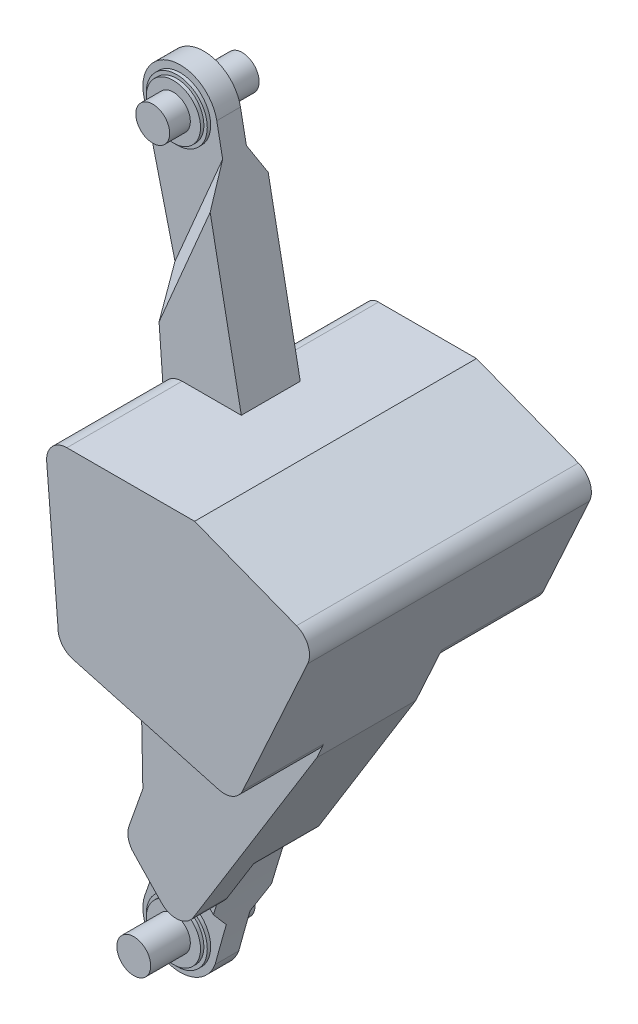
ISO-10303-21;
HEADER;
FILE_DESCRIPTION(('STEP AP214'),'2;1');
FILE_NAME('part.step','',(''),(''),'','','');
FILE_SCHEMA(('AUTOMOTIVE_DESIGN { 1 0 10303 214 1 1 1 1 }'));
ENDSEC;
DATA;
#1=APPLICATION_CONTEXT('core data for automotive mechanical design processes');
#2=APPLICATION_PROTOCOL_DEFINITION('international standard','automotive_design',2000,#1);
#3=PRODUCT_CONTEXT('',#1,'mechanical');
#4=PRODUCT('Part','Part','',(#3));
#5=PRODUCT_RELATED_PRODUCT_CATEGORY('part','',(#4));
#6=PRODUCT_DEFINITION_FORMATION('','',#4);
#7=PRODUCT_DEFINITION_CONTEXT('part definition',#1,'design');
#8=PRODUCT_DEFINITION('design','',#6,#7);
#9=PRODUCT_DEFINITION_SHAPE('','',#8);
#10=(LENGTH_UNIT() NAMED_UNIT(*) SI_UNIT(.MILLI.,.METRE.));
#11=(NAMED_UNIT(*) PLANE_ANGLE_UNIT() SI_UNIT($,.RADIAN.));
#12=(NAMED_UNIT(*) SI_UNIT($,.STERADIAN.) SOLID_ANGLE_UNIT());
#13=UNCERTAINTY_MEASURE_WITH_UNIT(LENGTH_MEASURE(1.E-05),#10,'distance_accuracy_value','');
#14=(GEOMETRIC_REPRESENTATION_CONTEXT(3) GLOBAL_UNCERTAINTY_ASSIGNED_CONTEXT((#13)) GLOBAL_UNIT_ASSIGNED_CONTEXT((#10,
#11,#12)) REPRESENTATION_CONTEXT('',''));
#15=CARTESIAN_POINT('',(0.,0.,0.));
#16=DIRECTION('',(0.,0.,1.));
#17=DIRECTION('',(1.,0.,0.));
#18=AXIS2_PLACEMENT_3D('',#15,#16,#17);
#19=CARTESIAN_POINT('',(27.1145337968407,454.931877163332,58.4945264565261));
#20=DIRECTION('',(0.,0.,-1.));
#21=DIRECTION('',(0.,1.,0.));
#22=AXIS2_PLACEMENT_3D('',#19,#20,#21);
#23=PLANE('',#22);
#24=DIRECTION('',(-0.0174524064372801,0.999847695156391,0.));
#25=VECTOR('',#24,1.);
#26=CARTESIAN_POINT('',(49.7293486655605,305.303771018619,58.4945264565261));
#27=LINE('',#26,#25);
#28=CARTESIAN_POINT('',(49.7293486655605,305.303771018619,58.4945264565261));
#29=VERTEX_POINT('',#28);
#30=CARTESIAN_POINT('',(47.1114876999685,455.280925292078,58.4945264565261));
#31=VERTEX_POINT('',#30);
#32=EDGE_CURVE('E365',#29,#31,#27,.T.);
#33=ORIENTED_EDGE('',*,*,#32,.F.);
#34=DIRECTION('',(0.999847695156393,0.0174524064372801,0.));
#35=VECTOR('',#34,1.);
#36=CARTESIAN_POINT('',(29.7323947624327,304.954722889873,58.4945264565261));
#37=LINE('',#36,#35);
#38=CARTESIAN_POINT('',(74.7255410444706,305.74008117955,58.4945264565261));
#39=VERTEX_POINT('',#38);
#40=EDGE_CURVE('E374',#29,#39,#37,.T.);
#41=ORIENTED_EDGE('',*,*,#40,.T.);
#42=DIRECTION('',(-0.0174524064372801,0.999847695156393,0.));
#43=VECTOR('',#42,1.);
#44=CARTESIAN_POINT('',(72.1076800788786,455.71723545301,58.4945264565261));
#45=LINE('',#44,#43);
#46=CARTESIAN_POINT('',(72.1076800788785,455.71723545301,58.4945264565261));
#47=VERTEX_POINT('',#46);
#48=EDGE_CURVE('E699',#39,#47,#45,.T.);
#49=ORIENTED_EDGE('',*,*,#48,.T.);
#50=DIRECTION('',(0.999847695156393,0.0174524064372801,0.));
#51=VECTOR('',#50,1.);
#52=CARTESIAN_POINT('',(27.1145337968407,454.931877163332,58.4945264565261));
#53=LINE('',#52,#51);
#54=EDGE_CURVE('E376',#31,#47,#53,.T.);
#55=ORIENTED_EDGE('',*,*,#54,.F.);
#56=EDGE_LOOP('',(#33,#41,#49,#55));
#57=FACE_BOUND('',#56,.T.);
#58=ADVANCED_FACE('F35',(#57),#23,.F.);
#59=CARTESIAN_POINT('',(27.1145337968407,454.931877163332,58.4945264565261));
#60=DIRECTION('',(0.0174524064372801,-0.999847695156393,0.));
#61=DIRECTION('',(0.999847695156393,0.0174524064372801,0.));
#62=AXIS2_PLACEMENT_3D('',#59,#60,#61);
#63=PLANE('',#62);
#64=DIRECTION('',(0.,0.,-1.));
#65=VECTOR('',#64,1.);
#66=CARTESIAN_POINT('',(47.1114876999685,455.280925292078,58.4945264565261));
#67=LINE('',#66,#65);
#68=CARTESIAN_POINT('',(47.1114876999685,455.280925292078,8.49452645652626));
#69=VERTEX_POINT('',#68);
#70=EDGE_CURVE('E377',#31,#69,#67,.T.);
#71=ORIENTED_EDGE('',*,*,#70,.F.);
#72=ORIENTED_EDGE('',*,*,#54,.T.);
#73=DIRECTION('',(0.,0.,-1.));
#74=VECTOR('',#73,1.);
#75=CARTESIAN_POINT('',(72.1076800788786,455.71723545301,58.4945264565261));
#76=LINE('',#75,#74);
#77=CARTESIAN_POINT('',(72.1076800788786,455.71723545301,8.49452645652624));
#78=VERTEX_POINT('',#77);
#79=EDGE_CURVE('E697',#47,#78,#76,.T.);
#80=ORIENTED_EDGE('',*,*,#79,.T.);
#81=DIRECTION('',(0.999847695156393,0.0174524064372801,0.));
#82=VECTOR('',#81,1.);
#83=CARTESIAN_POINT('',(27.1145337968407,454.931877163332,8.49452645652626));
#84=LINE('',#83,#82);
#85=EDGE_CURVE('E385',#69,#78,#84,.T.);
#86=ORIENTED_EDGE('',*,*,#85,.F.);
#87=EDGE_LOOP('',(#71,#72,#80,#86));
#88=FACE_BOUND('',#87,.T.);
#89=ADVANCED_FACE('F567',(#88),#63,.F.);
#90=CARTESIAN_POINT('',(27.1145337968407,454.931877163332,8.49452645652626));
#91=DIRECTION('',(0.,0.,1.));
#92=DIRECTION('',(0.,-1.,0.));
#93=AXIS2_PLACEMENT_3D('',#90,#91,#92);
#94=PLANE('',#93);
#95=DIRECTION('',(0.0174524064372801,-0.999847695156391,0.));
#96=VECTOR('',#95,1.);
#97=CARTESIAN_POINT('',(47.1114876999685,455.280925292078,8.49452645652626));
#98=LINE('',#97,#96);
#99=CARTESIAN_POINT('',(49.7293486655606,305.303771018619,8.49452645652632));
#100=VERTEX_POINT('',#99);
#101=EDGE_CURVE('E51',#69,#100,#98,.T.);
#102=ORIENTED_EDGE('',*,*,#101,.F.);
#103=ORIENTED_EDGE('',*,*,#85,.T.);
#104=DIRECTION('',(0.0174524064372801,-0.999847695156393,0.));
#105=VECTOR('',#104,1.);
#106=CARTESIAN_POINT('',(72.1076800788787,455.71723545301,8.49452645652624));
#107=LINE('',#106,#105);
#108=CARTESIAN_POINT('',(74.7255410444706,305.74008117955,8.49452645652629));
#109=VERTEX_POINT('',#108);
#110=EDGE_CURVE('E387',#78,#109,#107,.T.);
#111=ORIENTED_EDGE('',*,*,#110,.T.);
#112=DIRECTION('',(0.999847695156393,0.0174524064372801,0.));
#113=VECTOR('',#112,1.);
#114=CARTESIAN_POINT('',(29.7323947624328,304.954722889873,8.49452645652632));
#115=LINE('',#114,#113);
#116=EDGE_CURVE('E383',#100,#109,#115,.T.);
#117=ORIENTED_EDGE('',*,*,#116,.F.);
#118=EDGE_LOOP('',(#102,#103,#111,#117));
#119=FACE_BOUND('',#118,.T.);
#120=ADVANCED_FACE('F572',(#119),#94,.F.);
#121=CARTESIAN_POINT('',(29.7323947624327,304.954722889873,58.4945264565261));
#122=DIRECTION('',(-0.0174524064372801,0.999847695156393,0.));
#123=DIRECTION('',(-0.999847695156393,-0.0174524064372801,0.));
#124=AXIS2_PLACEMENT_3D('',#121,#122,#123);
#125=PLANE('',#124);
#126=DIRECTION('',(0.,0.,1.));
#127=VECTOR('',#126,1.);
#128=CARTESIAN_POINT('',(49.7293486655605,305.303771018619,8.49452645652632));
#129=LINE('',#128,#127);
#130=EDGE_CURVE('E362',#100,#29,#129,.T.);
#131=ORIENTED_EDGE('',*,*,#130,.F.);
#132=ORIENTED_EDGE('',*,*,#116,.T.);
#133=DIRECTION('',(0.,0.,1.));
#134=VECTOR('',#133,1.);
#135=CARTESIAN_POINT('',(74.7255410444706,305.74008117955,58.4945264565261));
#136=LINE('',#135,#134);
#137=EDGE_CURVE('E382',#109,#39,#136,.T.);
#138=ORIENTED_EDGE('',*,*,#137,.T.);
#139=ORIENTED_EDGE('',*,*,#40,.F.);
#140=EDGE_LOOP('',(#131,#132,#138,#139));
#141=FACE_BOUND('',#140,.T.);
#142=ADVANCED_FACE('F380',(#141),#125,.F.);
#143=CARTESIAN_POINT('',(52.1699902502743,1100.5616696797,-10.0054735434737));
#144=DIRECTION('',(0.,0.,-1.));
#145=DIRECTION('',(-1.,0.,0.));
#146=AXIS2_PLACEMENT_3D('',#143,#144,#145);
#147=PLANE('',#146);
#148=CARTESIAN_POINT('',(52.1699902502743,1100.5616696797,-10.0054735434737));
#149=DIRECTION('',(0.,0.,-1.));
#150=DIRECTION('',(-1.,0.,0.));
#151=AXIS2_PLACEMENT_3D('',#148,#149,#150);
#152=CIRCLE('',#151,40.);
#153=CARTESIAN_POINT('',(12.1699902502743,1100.5616696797,-10.0054735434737));
#154=VERTEX_POINT('',#153);
#155=EDGE_CURVE('E701',#154,#154,#152,.T.);
#156=ORIENTED_EDGE('',*,*,#155,.T.);
#157=EDGE_LOOP('',(#156));
#158=FACE_BOUND('',#157,.T.);
#159=CARTESIAN_POINT('',(52.1699902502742,1100.5616696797,-10.0054735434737));
#160=DIRECTION('',(0.,0.,-1.));
#161=DIRECTION('',(-1.,0.,0.));
#162=AXIS2_PLACEMENT_3D('',#159,#160,#161);
#163=CIRCLE('',#162,25.);
#164=CARTESIAN_POINT('',(27.1699902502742,1100.5616696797,-10.0054735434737));
#165=VERTEX_POINT('',#164);
#166=EDGE_CURVE('E693',#165,#165,#163,.T.);
#167=ORIENTED_EDGE('',*,*,#166,.F.);
#168=EDGE_LOOP('',(#167));
#169=FACE_BOUND('',#168,.T.);
#170=ADVANCED_FACE('F673',(#158,#169),#147,.T.);
#171=CARTESIAN_POINT('',(52.1699902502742,1100.5616696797,44.9945264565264));
#172=DIRECTION('',(0.,0.,1.));
#173=DIRECTION('',(1.,0.,0.));
#174=AXIS2_PLACEMENT_3D('',#171,#172,#173);
#175=PLANE('',#174);
#176=CARTESIAN_POINT('',(52.1699902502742,1100.5616696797,44.9945264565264));
#177=DIRECTION('',(0.,0.,1.));
#178=DIRECTION('',(1.,0.,0.));
#179=AXIS2_PLACEMENT_3D('',#176,#177,#178);
#180=CIRCLE('',#179,40.);
#181=CARTESIAN_POINT('',(92.1699902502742,1100.5616696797,44.9945264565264));
#182=VERTEX_POINT('',#181);
#183=EDGE_CURVE('E706',#182,#182,#180,.T.);
#184=ORIENTED_EDGE('',*,*,#183,.T.);
#185=EDGE_LOOP('',(#184));
#186=FACE_BOUND('',#185,.T.);
#187=CARTESIAN_POINT('',(52.1699902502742,1100.5616696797,44.9945264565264));
#188=DIRECTION('',(0.,0.,1.));
#189=DIRECTION('',(1.,0.,0.));
#190=AXIS2_PLACEMENT_3D('',#187,#188,#189);
#191=CIRCLE('',#190,25.);
#192=CARTESIAN_POINT('',(77.1699902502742,1100.5616696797,44.9945264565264));
#193=VERTEX_POINT('',#192);
#194=EDGE_CURVE('E1054',#193,#193,#191,.T.);
#195=ORIENTED_EDGE('',*,*,#194,.F.);
#196=EDGE_LOOP('',(#195));
#197=FACE_BOUND('',#196,.T.);
#198=ADVANCED_FACE('F671',(#186,#197),#175,.T.);
#199=CARTESIAN_POINT('',(52.1699902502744,50.5616696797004,-10.0054735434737));
#200=DIRECTION('',(0.,0.,-1.));
#201=DIRECTION('',(-1.,0.,0.));
#202=AXIS2_PLACEMENT_3D('',#199,#200,#201);
#203=PLANE('',#202);
#204=CARTESIAN_POINT('',(52.1699902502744,50.5616696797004,-10.0054735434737));
#205=DIRECTION('',(0.,0.,-1.));
#206=DIRECTION('',(-1.,0.,0.));
#207=AXIS2_PLACEMENT_3D('',#204,#205,#206);
#208=CIRCLE('',#207,40.);
#209=CARTESIAN_POINT('',(12.1699902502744,50.5616696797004,-10.0054735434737));
#210=VERTEX_POINT('',#209);
#211=EDGE_CURVE('E712',#210,#210,#208,.T.);
#212=ORIENTED_EDGE('',*,*,#211,.T.);
#213=EDGE_LOOP('',(#212));
#214=FACE_BOUND('',#213,.T.);
#215=CARTESIAN_POINT('',(52.1699902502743,50.5616696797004,-10.0054735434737));
#216=DIRECTION('',(0.,0.,-1.));
#217=DIRECTION('',(-1.,0.,0.));
#218=AXIS2_PLACEMENT_3D('',#215,#216,#217);
#219=CIRCLE('',#218,25.);
#220=CARTESIAN_POINT('',(27.1699902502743,50.5616696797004,-10.0054735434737));
#221=VERTEX_POINT('',#220);
#222=EDGE_CURVE('E1048',#221,#221,#219,.T.);
#223=ORIENTED_EDGE('',*,*,#222,.F.);
#224=EDGE_LOOP('',(#223));
#225=FACE_BOUND('',#224,.T.);
#226=ADVANCED_FACE('F670',(#214,#225),#203,.T.);
#227=CARTESIAN_POINT('',(52.1699902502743,50.5616696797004,44.9945264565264));
#228=DIRECTION('',(0.,0.,1.));
#229=DIRECTION('',(1.,0.,0.));
#230=AXIS2_PLACEMENT_3D('',#227,#228,#229);
#231=PLANE('',#230);
#232=CARTESIAN_POINT('',(52.1699902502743,50.5616696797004,44.9945264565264));
#233=DIRECTION('',(0.,0.,1.));
#234=DIRECTION('',(1.,0.,0.));
#235=AXIS2_PLACEMENT_3D('',#232,#233,#234);
#236=CIRCLE('',#235,40.);
#237=CARTESIAN_POINT('',(92.1699902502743,50.5616696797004,44.9945264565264));
#238=VERTEX_POINT('',#237);
#239=EDGE_CURVE('E715',#238,#238,#236,.T.);
#240=ORIENTED_EDGE('',*,*,#239,.T.);
#241=EDGE_LOOP('',(#240));
#242=FACE_BOUND('',#241,.T.);
#243=CARTESIAN_POINT('',(52.1699902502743,50.5616696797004,44.9945264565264));
#244=DIRECTION('',(0.,0.,1.));
#245=DIRECTION('',(1.,0.,0.));
#246=AXIS2_PLACEMENT_3D('',#243,#244,#245);
#247=CIRCLE('',#246,25.);
#248=CARTESIAN_POINT('',(77.1699902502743,50.5616696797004,44.9945264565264));
#249=VERTEX_POINT('',#248);
#250=EDGE_CURVE('E1042',#249,#249,#247,.T.);
#251=ORIENTED_EDGE('',*,*,#250,.F.);
#252=EDGE_LOOP('',(#251));
#253=FACE_BOUND('',#252,.T.);
#254=ADVANCED_FACE('F1219',(#242,#253),#231,.T.);
#255=CARTESIAN_POINT('',(3964.69019911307,-1014.00064638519,34.9945264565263));
#256=DIRECTION('',(0.,0.,-1.));
#257=DIRECTION('',(-1.,0.,0.));
#258=AXIS2_PLACEMENT_3D('',#255,#256,#257);
#259=CYLINDRICAL_SURFACE('',#258,4000.);
#260=DIRECTION('',(0.,0.,1.));
#261=VECTOR('',#260,1.);
#262=CARTESIAN_POINT('',(157.495576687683,212.893443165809,-299.963916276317));
#263=LINE('',#262,#261);
#264=CARTESIAN_POINT('',(157.495576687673,212.893443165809,-24.0054735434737));
#265=VERTEX_POINT('',#264);
#266=CARTESIAN_POINT('',(157.495576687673,212.893443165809,62.9945264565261));
#267=VERTEX_POINT('',#266);
#268=EDGE_CURVE('E1030',#265,#267,#263,.T.);
#269=ORIENTED_EDGE('',*,*,#268,.T.);
#270=CARTESIAN_POINT('',(3964.69019911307,-1014.00064638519,62.9945264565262));
#271=DIRECTION('',(0.,0.,1.));
#272=DIRECTION('',(0.,-1.,0.));
#273=AXIS2_PLACEMENT_3D('',#270,#271,#272);
#274=CIRCLE('',#273,4000.);
#275=CARTESIAN_POINT('',(135.243751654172,141.56843681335,62.9945264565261));
#276=VERTEX_POINT('',#275);
#277=EDGE_CURVE('E737',#276,#267,#274,.F.);
#278=ORIENTED_EDGE('',*,*,#277,.F.);
#279=CARTESIAN_POINT('',(3964.69019911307,-1014.00064638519,62.9945264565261));
#280=DIRECTION('',(0.,0.,-1.));
#281=DIRECTION('',(1.,0.,0.));
#282=AXIS2_PLACEMENT_3D('',#279,#280,#281);
#283=CIRCLE('',#282,4000.);
#284=CARTESIAN_POINT('',(129.292486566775,121.65968425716,62.994526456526));
#285=VERTEX_POINT('',#284);
#286=EDGE_CURVE('E415',#285,#276,#283,.T.);
#287=ORIENTED_EDGE('',*,*,#286,.F.);
#288=CARTESIAN_POINT('',(3964.69019911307,-1014.00064638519,2060.50000915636));
#289=DIRECTION('',(0.512515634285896,0.487162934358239,-0.707106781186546));
#290=DIRECTION('',(-0.512515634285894,-0.487162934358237,-0.707106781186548));
#291=AXIS2_PLACEMENT_3D('',#288,#289,#290);
#292=ELLIPSE('',#291,5656.85424949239,4000.);
#293=CARTESIAN_POINT('',(120.221173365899,90.5616696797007,34.9945264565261));
#294=VERTEX_POINT('',#293);
#295=EDGE_CURVE('E539',#285,#294,#292,.F.);
#296=ORIENTED_EDGE('',*,*,#295,.T.);
#297=CARTESIAN_POINT('',(3964.69019911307,-1014.00064638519,34.9945264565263));
#298=DIRECTION('',(0.,0.,-1.));
#299=DIRECTION('',(-1.,0.,0.));
#300=AXIS2_PLACEMENT_3D('',#297,#298,#299);
#301=CIRCLE('',#300,4000.);
#302=CARTESIAN_POINT('',(103.686960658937,31.3002637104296,34.9945264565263));
#303=VERTEX_POINT('',#302);
#304=EDGE_CURVE('E487',#303,#294,#301,.T.);
#305=ORIENTED_EDGE('',*,*,#304,.F.);
#306=DIRECTION('',(0.,0.,-1.));
#307=VECTOR('',#306,1.);
#308=CARTESIAN_POINT('',(103.686960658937,31.3002637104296,34.9945264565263));
#309=LINE('',#308,#307);
#310=CARTESIAN_POINT('',(103.686960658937,31.3002637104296,-0.00547354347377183));
#311=VERTEX_POINT('',#310);
#312=EDGE_CURVE('E495',#303,#311,#309,.T.);
#313=ORIENTED_EDGE('',*,*,#312,.T.);
#314=CARTESIAN_POINT('',(3964.69019911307,-1014.00064638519,-0.00547354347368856));
#315=DIRECTION('',(0.,0.,-1.));
#316=DIRECTION('',(-1.,0.,0.));
#317=AXIS2_PLACEMENT_3D('',#314,#315,#316);
#318=CIRCLE('',#317,4000.);
#319=CARTESIAN_POINT('',(120.221173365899,90.5616696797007,-0.00547354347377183));
#320=VERTEX_POINT('',#319);
#321=EDGE_CURVE('E472',#311,#320,#318,.T.);
#322=ORIENTED_EDGE('',*,*,#321,.T.);
#323=CARTESIAN_POINT('',(3964.69019911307,-1014.00064638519,-2025.5109562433));
#324=DIRECTION('',(-0.512515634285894,-0.487162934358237,-0.707106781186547));
#325=DIRECTION('',(0.512515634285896,0.487162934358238,-0.707106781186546));
#326=AXIS2_PLACEMENT_3D('',#323,#324,#325);
#327=ELLIPSE('',#326,5656.85424949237,4000.);
#328=CARTESIAN_POINT('',(127.983803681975,117.230556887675,-24.0054735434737));
#329=VERTEX_POINT('',#328);
#330=EDGE_CURVE('E450',#320,#329,#327,.T.);
#331=ORIENTED_EDGE('',*,*,#330,.T.);
#332=CARTESIAN_POINT('',(3964.69019911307,-1014.00064638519,-24.0054735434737));
#333=DIRECTION('',(0.,0.,-1.));
#334=DIRECTION('',(1.,0.,0.));
#335=AXIS2_PLACEMENT_3D('',#332,#333,#334);
#336=CIRCLE('',#335,4000.);
#337=EDGE_CURVE('E59',#329,#265,#336,.T.);
#338=ORIENTED_EDGE('',*,*,#337,.T.);
#339=EDGE_LOOP('',(#269,#278,#287,#296,#305,#313,#322,#331,#338));
#340=FACE_BOUND('',#339,.T.);
#341=ADVANCED_FACE('F1207',(#340),#259,.F.);
#342=CARTESIAN_POINT('',(145.581318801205,499.883655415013,500000.));
#343=DIRECTION('',(0.264252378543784,0.964453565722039,0.));
#344=DIRECTION('',(-0.964453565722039,0.264252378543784,0.));
#345=AXIS2_PLACEMENT_3D('',#342,#343,#344);
#346=PLANE('',#345);
#347=DIRECTION('',(0.,0.,-1.));
#348=VECTOR('',#347,1.);
#349=CARTESIAN_POINT('',(231.667125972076,476.296849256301,500000.));
#350=LINE('',#349,#348);
#351=CARTESIAN_POINT('',(231.667125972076,476.296849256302,-24.0054735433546));
#352=VERTEX_POINT('',#351);
#353=CARTESIAN_POINT('',(231.667125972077,476.296849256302,-33.0054735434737));
#354=VERTEX_POINT('',#353);
#355=EDGE_CURVE('E730',#352,#354,#350,.T.);
#356=ORIENTED_EDGE('',*,*,#355,.F.);
#357=DIRECTION('',(-0.964453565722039,0.264252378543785,0.));
#358=VECTOR('',#357,1.);
#359=CARTESIAN_POINT('',(231.667125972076,476.296849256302,-24.0054735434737));
#360=LINE('',#359,#358);
#361=CARTESIAN_POINT('',(145.581318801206,499.883655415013,-24.0054735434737));
#362=VERTEX_POINT('',#361);
#363=EDGE_CURVE('E991',#352,#362,#360,.T.);
#364=ORIENTED_EDGE('',*,*,#363,.T.);
#365=DIRECTION('',(0.,0.,1.));
#366=VECTOR('',#365,1.);
#367=CARTESIAN_POINT('',(145.581318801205,499.883655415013,-183.005473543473));
#368=LINE('',#367,#366);
#369=CARTESIAN_POINT('',(145.581318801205,499.883655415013,-183.005473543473));
#370=VERTEX_POINT('',#369);
#371=EDGE_CURVE('E752',#362,#370,#368,.F.);
#372=ORIENTED_EDGE('',*,*,#371,.T.);
#373=DIRECTION('',(-0.964453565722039,0.264252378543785,0.));
#374=VECTOR('',#373,1.);
#375=CARTESIAN_POINT('',(231.667125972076,476.296849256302,-183.005473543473));
#376=LINE('',#375,#374);
#377=CARTESIAN_POINT('',(231.667125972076,476.296849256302,-183.005473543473));
#378=VERTEX_POINT('',#377);
#379=EDGE_CURVE('E862',#378,#370,#376,.T.);
#380=ORIENTED_EDGE('',*,*,#379,.F.);
#381=DIRECTION('',(0.,0.,1.));
#382=VECTOR('',#381,1.);
#383=CARTESIAN_POINT('',(231.667125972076,476.296849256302,-183.005473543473));
#384=LINE('',#383,#382);
#385=EDGE_CURVE('E818',#378,#354,#384,.T.);
#386=ORIENTED_EDGE('',*,*,#385,.T.);
#387=EDGE_LOOP('',(#356,#364,#372,#380,#386));
#388=FACE_BOUND('',#387,.T.);
#389=ADVANCED_FACE('F876',(#388),#346,.F.);
#390=CARTESIAN_POINT('',(3966.19460881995,-1009.29005606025,-318.764821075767));
#391=DIRECTION('',(0.,0.,1.));
#392=DIRECTION('',(0.999999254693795,0.00122090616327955,0.));
#393=AXIS2_PLACEMENT_3D('',#390,#391,#392);
#394=CYLINDRICAL_SURFACE('',#393,3991.);
#395=CARTESIAN_POINT('',(3966.19460881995,-1009.29005606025,-24.0054735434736));
#396=DIRECTION('',(0.,0.,1.));
#397=DIRECTION('',(1.,0.,0.));
#398=AXIS2_PLACEMENT_3D('',#395,#396,#397);
#399=CIRCLE('',#398,3991.);
#400=CARTESIAN_POINT('',(171.175816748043,225.988603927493,-24.0054735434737));
#401=VERTEX_POINT('',#400);
#402=CARTESIAN_POINT('',(207.857169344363,333.461108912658,-24.0054735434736));
#403=VERTEX_POINT('',#402);
#404=EDGE_CURVE('E1023',#401,#403,#399,.F.);
#405=ORIENTED_EDGE('',*,*,#404,.T.);
#406=DIRECTION('',(0.,0.,1.));
#407=VECTOR('',#406,1.);
#408=CARTESIAN_POINT('',(207.857169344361,333.461108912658,-318.764821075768));
#409=LINE('',#408,#407);
#410=CARTESIAN_POINT('',(207.857169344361,333.461108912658,-33.0054735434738));
#411=VERTEX_POINT('',#410);
#412=EDGE_CURVE('E999',#411,#403,#409,.T.);
#413=ORIENTED_EDGE('',*,*,#412,.F.);
#414=CARTESIAN_POINT('',(3966.19460881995,-1009.29005606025,-33.0054735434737));
#415=DIRECTION('',(0.,0.,-1.));
#416=DIRECTION('',(-0.999999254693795,-0.00122090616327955,0.));
#417=AXIS2_PLACEMENT_3D('',#414,#415,#416);
#418=CIRCLE('',#417,3991.);
#419=CARTESIAN_POINT('',(171.175816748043,225.988603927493,-33.0054735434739));
#420=VERTEX_POINT('',#419);
#421=EDGE_CURVE('E996',#420,#411,#418,.T.);
#422=ORIENTED_EDGE('',*,*,#421,.F.);
#423=DIRECTION('',(0.,0.,1.));
#424=VECTOR('',#423,1.);
#425=CARTESIAN_POINT('',(171.175816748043,225.988603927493,-318.764821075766));
#426=LINE('',#425,#424);
#427=EDGE_CURVE('E1002',#420,#401,#426,.T.);
#428=ORIENTED_EDGE('',*,*,#427,.T.);
#429=EDGE_LOOP('',(#405,#413,#422,#428));
#430=FACE_BOUND('',#429,.T.);
#431=ADVANCED_FACE('F1145',(#430),#394,.T.);
#432=CARTESIAN_POINT('',(180.684758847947,222.89344316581,-318.764821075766));
#433=DIRECTION('',(0.,0.,1.));
#434=DIRECTION('',(0.999999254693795,0.00122090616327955,0.));
#435=AXIS2_PLACEMENT_3D('',#432,#433,#434);
#436=CYLINDRICAL_SURFACE('',#435,9.9999999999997);
#437=DIRECTION('',(0.,0.,1.));
#438=VECTOR('',#437,1.);
#439=CARTESIAN_POINT('',(180.684758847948,212.893443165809,-299.963916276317));
#440=LINE('',#439,#438);
#441=CARTESIAN_POINT('',(180.684758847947,212.893443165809,-24.0054735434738));
#442=VERTEX_POINT('',#441);
#443=CARTESIAN_POINT('',(180.684758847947,212.893443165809,62.9945264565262));
#444=VERTEX_POINT('',#443);
#445=EDGE_CURVE('E1027',#442,#444,#440,.T.);
#446=ORIENTED_EDGE('',*,*,#445,.F.);
#447=CARTESIAN_POINT('',(180.684758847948,222.89344316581,-24.0054735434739));
#448=DIRECTION('',(0.,0.,1.));
#449=DIRECTION('',(1.,0.,0.));
#450=AXIS2_PLACEMENT_3D('',#447,#448,#449);
#451=CIRCLE('',#450,9.99999999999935);
#452=EDGE_CURVE('E1022',#442,#401,#451,.F.);
#453=ORIENTED_EDGE('',*,*,#452,.T.);
#454=ORIENTED_EDGE('',*,*,#427,.F.);
#455=CARTESIAN_POINT('',(180.684758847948,222.89344316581,-33.0054735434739));
#456=DIRECTION('',(0.,0.,-1.));
#457=DIRECTION('',(-0.999999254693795,-0.00122090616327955,0.));
#458=AXIS2_PLACEMENT_3D('',#455,#456,#457);
#459=CIRCLE('',#458,9.9999999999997);
#460=CARTESIAN_POINT('',(189.194381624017,217.641175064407,-33.0054735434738));
#461=VERTEX_POINT('',#460);
#462=EDGE_CURVE('E1011',#461,#420,#459,.T.);
#463=ORIENTED_EDGE('',*,*,#462,.F.);
#464=DIRECTION('',(0.,0.,1.));
#465=VECTOR('',#464,1.);
#466=CARTESIAN_POINT('',(189.194381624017,217.641175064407,-318.764821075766));
#467=LINE('',#466,#465);
#468=CARTESIAN_POINT('',(189.194381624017,217.641175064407,62.9945264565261));
#469=VERTEX_POINT('',#468);
#470=EDGE_CURVE('E1006',#461,#469,#467,.T.);
#471=ORIENTED_EDGE('',*,*,#470,.T.);
#472=CARTESIAN_POINT('',(180.684758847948,222.89344316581,62.9945264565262));
#473=DIRECTION('',(0.,0.,-1.));
#474=DIRECTION('',(-0.999999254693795,-0.00122090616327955,0.));
#475=AXIS2_PLACEMENT_3D('',#472,#473,#474);
#476=CIRCLE('',#475,9.9999999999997);
#477=EDGE_CURVE('E1005',#469,#444,#476,.T.);
#478=ORIENTED_EDGE('',*,*,#477,.T.);
#479=EDGE_LOOP('',(#446,#453,#454,#463,#471,#478));
#480=FACE_BOUND('',#479,.T.);
#481=ADVANCED_FACE('F1148',(#480),#436,.T.);
#482=CARTESIAN_POINT('',(451.571489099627,710.982517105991,62.9945264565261));
#483=DIRECTION('',(0.,0.,1.));
#484=DIRECTION('',(0.999999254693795,0.00122090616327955,0.));
#485=AXIS2_PLACEMENT_3D('',#482,#483,#484);
#486=PLANE('',#485);
#487=DIRECTION('',(-1.,0.,0.));
#488=VECTOR('',#487,1.);
#489=CARTESIAN_POINT('',(180.684758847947,212.893443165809,62.9945264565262));
#490=LINE('',#489,#488);
#491=EDGE_CURVE('E1032',#444,#267,#490,.T.);
#492=ORIENTED_EDGE('',*,*,#491,.F.);
#493=ORIENTED_EDGE('',*,*,#477,.F.);
#494=DIRECTION('',(-0.525226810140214,-0.850962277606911,0.));
#495=VECTOR('',#494,1.);
#496=CARTESIAN_POINT('',(129.292064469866,120.588604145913,62.994526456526));
#497=LINE('',#496,#495);
#498=CARTESIAN_POINT('',(149.732955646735,153.706539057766,62.9945264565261));
#499=VERTEX_POINT('',#498);
#500=EDGE_CURVE('E993',#469,#499,#497,.T.);
#501=ORIENTED_EDGE('',*,*,#500,.T.);
#502=CARTESIAN_POINT('',(124.204087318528,169.463343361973,62.994526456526));
#503=DIRECTION('',(0.,0.,1.));
#504=DIRECTION('',(0.999999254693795,0.00122090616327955,0.));
#505=AXIS2_PLACEMENT_3D('',#502,#503,#504);
#506=CIRCLE('',#505,30.);
#507=EDGE_CURVE('E785',#499,#276,#506,.F.);
#508=ORIENTED_EDGE('',*,*,#507,.T.);
#509=ORIENTED_EDGE('',*,*,#277,.T.);
#510=EDGE_LOOP('',(#492,#493,#501,#508,#509));
#511=FACE_BOUND('',#510,.T.);
#512=ADVANCED_FACE('F1152',(#511),#486,.F.);
#513=CARTESIAN_POINT('',(-177.299436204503,471.067028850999,-33.0054735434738));
#514=DIRECTION('',(0.,0.,1.));
#515=DIRECTION('',(0.999999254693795,0.00122090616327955,0.));
#516=AXIS2_PLACEMENT_3D('',#513,#514,#515);
#517=CYLINDRICAL_SURFACE('',#516,409.);
#518=CARTESIAN_POINT('',(-177.299436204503,471.067028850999,-24.0054735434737));
#519=DIRECTION('',(0.,0.,1.));
#520=DIRECTION('',(1.,0.,0.));
#521=AXIS2_PLACEMENT_3D('',#518,#519,#520);
#522=CIRCLE('',#521,409.);
#523=EDGE_CURVE('E1026',#403,#352,#522,.T.);
#524=ORIENTED_EDGE('',*,*,#523,.T.);
#525=ORIENTED_EDGE('',*,*,#355,.T.);
#526=CARTESIAN_POINT('',(-177.299436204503,471.067028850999,-33.0054735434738));
#527=DIRECTION('',(0.,0.,1.));
#528=DIRECTION('',(-0.999999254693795,-0.00122090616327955,0.));
#529=AXIS2_PLACEMENT_3D('',#526,#527,#528);
#530=CIRCLE('',#529,409.);
#531=EDGE_CURVE('E873',#411,#354,#530,.T.);
#532=ORIENTED_EDGE('',*,*,#531,.F.);
#533=ORIENTED_EDGE('',*,*,#412,.T.);
#534=EDGE_LOOP('',(#524,#525,#532,#533));
#535=FACE_BOUND('',#534,.T.);
#536=ADVANCED_FACE('F625',(#535),#517,.F.);
#537=CARTESIAN_POINT('',(-176.993380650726,471.414152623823,-24.0054735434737));
#538=DIRECTION('',(0.,0.,1.));
#539=DIRECTION('',(1.,0.,0.));
#540=AXIS2_PLACEMENT_3D('',#537,#538,#539);
#541=PLANE('',#540);
#542=ORIENTED_EDGE('',*,*,#363,.F.);
#543=ORIENTED_EDGE('',*,*,#523,.F.);
#544=ORIENTED_EDGE('',*,*,#404,.F.);
#545=ORIENTED_EDGE('',*,*,#452,.F.);
#546=DIRECTION('',(1.,0.,0.));
#547=VECTOR('',#546,1.);
#548=CARTESIAN_POINT('',(180.684758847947,212.893443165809,-24.0054735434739));
#549=LINE('',#548,#547);
#550=EDGE_CURVE('E1037',#265,#442,#549,.T.);
#551=ORIENTED_EDGE('',*,*,#550,.F.);
#552=ORIENTED_EDGE('',*,*,#337,.F.);
#553=DIRECTION('',(-0.688952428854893,0.724806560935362,0.));
#554=VECTOR('',#553,1.);
#555=CARTESIAN_POINT('',(55.8465931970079,193.121897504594,-24.0054735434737));
#556=LINE('',#555,#554);
#557=CARTESIAN_POINT('',(47.4388276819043,201.967215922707,-24.0054735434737));
#558=VERTEX_POINT('',#557);
#559=EDGE_CURVE('E519',#329,#558,#556,.T.);
#560=ORIENTED_EDGE('',*,*,#559,.T.);
#561=DIRECTION('',(-0.333806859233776,-0.942641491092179,0.));
#562=VECTOR('',#561,1.);
#563=CARTESIAN_POINT('',(75.1699902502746,280.277603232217,-24.0054735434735));
#564=LINE('',#563,#562);
#565=CARTESIAN_POINT('',(75.1699902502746,280.277603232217,-24.0054735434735));
#566=VERTEX_POINT('',#565);
#567=EDGE_CURVE('E425',#566,#558,#564,.T.);
#568=ORIENTED_EDGE('',*,*,#567,.F.);
#569=DIRECTION('',(0.0174524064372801,-0.999847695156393,0.));
#570=VECTOR('',#569,1.);
#571=CARTESIAN_POINT('',(70.5192164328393,546.720256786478,-24.0054735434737));
#572=LINE('',#571,#570);
#573=CARTESIAN_POINT('',(70.5192164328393,546.720256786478,-24.0054735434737));
#574=VERTEX_POINT('',#573);
#575=EDGE_CURVE('E422',#574,#566,#572,.T.);
#576=ORIENTED_EDGE('',*,*,#575,.F.);
#577=DIRECTION('',(0.0732381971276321,-0.99731447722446,0.));
#578=VECTOR('',#577,1.);
#579=CARTESIAN_POINT('',(44.5347273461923,900.561669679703,-24.0054735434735));
#580=LINE('',#579,#578);
#581=CARTESIAN_POINT('',(48.3801106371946,848.197513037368,-24.0054735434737));
#582=VERTEX_POINT('',#581);
#583=EDGE_CURVE('E420',#582,#574,#580,.T.);
#584=ORIENTED_EDGE('',*,*,#583,.F.);
#585=DIRECTION('',(0.390731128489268,0.920504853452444,0.));
#586=VECTOR('',#585,1.);
#587=CARTESIAN_POINT('',(136.959885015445,1056.87838407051,-24.0054735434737));
#588=LINE('',#587,#586);
#589=CARTESIAN_POINT('',(123.057099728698,1024.12547446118,-24.0054735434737));
#590=VERTEX_POINT('',#589);
#591=EDGE_CURVE('E516',#582,#590,#588,.T.);
#592=ORIENTED_EDGE('',*,*,#591,.T.);
#593=DIRECTION('',(-0.190808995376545,0.981627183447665,0.));
#594=VECTOR('',#593,1.);
#595=CARTESIAN_POINT('',(215.657492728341,547.737750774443,-24.0054735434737));
#596=LINE('',#595,#594);
#597=CARTESIAN_POINT('',(170.386023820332,780.639267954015,-24.0054735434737));
#598=VERTEX_POINT('',#597);
#599=EDGE_CURVE('E418',#598,#590,#596,.T.);
#600=ORIENTED_EDGE('',*,*,#599,.F.);
#601=DIRECTION('',(0.999999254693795,0.00122090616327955,0.));
#602=VECTOR('',#601,1.);
#603=CARTESIAN_POINT('',(101.486286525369,780.555147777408,-24.0054735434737));
#604=LINE('',#603,#602);
#605=CARTESIAN_POINT('',(126.854203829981,780.586119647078,-24.0054735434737));
#606=VERTEX_POINT('',#605);
#607=EDGE_CURVE('E985',#606,#598,#604,.T.);
#608=ORIENTED_EDGE('',*,*,#607,.F.);
#609=CARTESIAN_POINT('',(126.878621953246,760.586134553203,-24.0054735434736));
#610=DIRECTION('',(0.,0.,1.));
#611=DIRECTION('',(0.999999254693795,0.00122090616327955,0.));
#612=AXIS2_PLACEMENT_3D('',#609,#610,#611);
#613=CIRCLE('',#612,20.);
#614=CARTESIAN_POINT('',(107.436588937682,755.894935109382,-24.0054735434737));
#615=VERTEX_POINT('',#614);
#616=EDGE_CURVE('E744',#606,#615,#613,.T.);
#617=ORIENTED_EDGE('',*,*,#616,.T.);
#618=DIRECTION('',(-0.234559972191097,0.972101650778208,0.));
#619=VECTOR('',#618,1.);
#620=CARTESIAN_POINT('',(101.486286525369,780.555147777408,-24.0054735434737));
#621=LINE('',#620,#619);
#622=CARTESIAN_POINT('',(131.638877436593,655.591868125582,-24.0054735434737));
#623=VERTEX_POINT('',#622);
#624=EDGE_CURVE('E987',#623,#615,#621,.T.);
#625=ORIENTED_EDGE('',*,*,#624,.F.);
#626=DIRECTION('',(0.134115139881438,0.990965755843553,0.));
#627=VECTOR('',#626,1.);
#628=CARTESIAN_POINT('',(131.638877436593,655.591868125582,-24.0054735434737));
#629=LINE('',#628,#627);
#630=CARTESIAN_POINT('',(116.512783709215,543.826403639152,-24.0054735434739));
#631=VERTEX_POINT('',#630);
#632=EDGE_CURVE('E989',#631,#623,#629,.T.);
#633=ORIENTED_EDGE('',*,*,#632,.F.);
#634=CARTESIAN_POINT('',(156.151413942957,538.461798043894,-24.0054735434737));
#635=DIRECTION('',(0.,0.,1.));
#636=DIRECTION('',(0.999999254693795,0.00122090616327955,0.));
#637=AXIS2_PLACEMENT_3D('',#634,#635,#636);
#638=CIRCLE('',#637,40.);
#639=EDGE_CURVE('E754',#631,#362,#638,.T.);
#640=ORIENTED_EDGE('',*,*,#639,.T.);
#641=EDGE_LOOP('',(#542,#543,#544,#545,#551,#552,#560,#568,#576,#584,#592,#600,#608,#617,#625,
#633,#640));
#642=FACE_BOUND('',#641,.T.);
#643=ADVANCED_FACE('F622',(#642),#541,.F.);
#644=CARTESIAN_POINT('',(-176.993380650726,471.414152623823,62.994526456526));
#645=DIRECTION('',(0.,0.,1.));
#646=DIRECTION('',(1.,0.,0.));
#647=AXIS2_PLACEMENT_3D('',#644,#645,#646);
#648=PLANE('',#647);
#649=CARTESIAN_POINT('',(107.609848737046,144.470719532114,62.9945264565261));
#650=VERTEX_POINT('',#649);
#651=EDGE_CURVE('E788',#276,#650,#506,.F.);
#652=ORIENTED_EDGE('',*,*,#651,.T.);
#653=DIRECTION('',(0.688952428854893,-0.724806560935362,0.));
#654=VECTOR('',#653,1.);
#655=CARTESIAN_POINT('',(-190.740195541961,458.347353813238,62.994526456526));
#656=LINE('',#655,#654);
#657=EDGE_CURVE('E527',#650,#285,#656,.T.);
#658=ORIENTED_EDGE('',*,*,#657,.T.);
#659=ORIENTED_EDGE('',*,*,#286,.T.);
#660=EDGE_LOOP('',(#652,#658,#659));
#661=FACE_BOUND('',#660,.T.);
#662=ADVANCED_FACE('F620',(#661),#648,.T.);
#663=CARTESIAN_POINT('',(82.9507293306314,212.829152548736,62.9945264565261));
#664=DIRECTION('',(0.,0.,1.));
#665=DIRECTION('',(0.999999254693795,0.00122090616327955,0.));
#666=AXIS2_PLACEMENT_3D('',#663,#664,#665);
#667=CIRCLE('',#666,30.);
#668=CARTESIAN_POINT('',(57.0953190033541,197.614102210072,62.994526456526));
#669=VERTEX_POINT('',#668);
#670=CARTESIAN_POINT('',(53.8108171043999,219.961158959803,62.9945264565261));
#671=VERTEX_POINT('',#670);
#672=EDGE_CURVE('E793',#669,#671,#667,.F.);
#673=ORIENTED_EDGE('',*,*,#672,.T.);
#674=DIRECTION('',(-0.333806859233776,-0.942641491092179,0.));
#675=VECTOR('',#674,1.);
#676=CARTESIAN_POINT('',(75.1699902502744,280.277603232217,62.994526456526));
#677=LINE('',#676,#675);
#678=CARTESIAN_POINT('',(48.9367596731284,206.197245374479,62.9945264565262));
#679=VERTEX_POINT('',#678);
#680=EDGE_CURVE('E412',#671,#679,#677,.T.);
#681=ORIENTED_EDGE('',*,*,#680,.T.);
#682=EDGE_CURVE('E528',#679,#669,#656,.T.);
#683=ORIENTED_EDGE('',*,*,#682,.T.);
#684=EDGE_LOOP('',(#673,#681,#683));
#685=FACE_BOUND('',#684,.T.);
#686=ADVANCED_FACE('F1291',(#685),#648,.T.);
#687=CARTESIAN_POINT('',(106.159485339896,1111.05616442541,34.9945264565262));
#688=DIRECTION('',(-0.981627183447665,-0.190808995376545,0.));
#689=DIRECTION('',(0.190808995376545,-0.981627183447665,0.));
#690=AXIS2_PLACEMENT_3D('',#687,#688,#689);
#691=PLANE('',#690);
#692=DIRECTION('',(0.,0.,1.));
#693=VECTOR('',#692,1.);
#694=CARTESIAN_POINT('',(170.386023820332,780.639267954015,34.9945264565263));
#695=LINE('',#694,#693);
#696=CARTESIAN_POINT('',(170.386023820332,780.639267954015,62.9945264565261));
#697=VERTEX_POINT('',#696);
#698=EDGE_CURVE('E727',#598,#697,#695,.T.);
#699=ORIENTED_EDGE('',*,*,#698,.F.);
#700=ORIENTED_EDGE('',*,*,#599,.T.);
#701=DIRECTION('',(-0.166539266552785,0.856770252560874,0.488067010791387));
#702=VECTOR('',#701,1.);
#703=CARTESIAN_POINT('',(114.867768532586,1066.25593115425,-0.00547354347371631));
#704=LINE('',#703,#702);
#705=CARTESIAN_POINT('',(114.867768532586,1066.25593115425,-0.00547354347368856));
#706=VERTEX_POINT('',#705);
#707=EDGE_CURVE('E525',#590,#706,#704,.T.);
#708=ORIENTED_EDGE('',*,*,#707,.T.);
#709=DIRECTION('',(-0.190808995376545,0.981627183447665,0.));
#710=VECTOR('',#709,1.);
#711=CARTESIAN_POINT('',(106.159485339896,1111.05616442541,-0.00547354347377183));
#712=LINE('',#711,#710);
#713=CARTESIAN_POINT('',(106.159485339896,1111.05616442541,-0.00547354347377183));
#714=VERTEX_POINT('',#713);
#715=EDGE_CURVE('E475',#706,#714,#712,.T.);
#716=ORIENTED_EDGE('',*,*,#715,.T.);
#717=DIRECTION('',(0.,0.,-1.));
#718=VECTOR('',#717,1.);
#719=CARTESIAN_POINT('',(106.159485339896,1111.05616442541,34.9945264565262));
#720=LINE('',#719,#718);
#721=CARTESIAN_POINT('',(106.159485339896,1111.05616442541,34.9945264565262));
#722=VERTEX_POINT('',#721);
#723=EDGE_CURVE('E492',#722,#714,#720,.T.);
#724=ORIENTED_EDGE('',*,*,#723,.F.);
#725=DIRECTION('',(-0.190808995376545,0.981627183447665,0.));
#726=VECTOR('',#725,1.);
#727=CARTESIAN_POINT('',(106.159485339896,1111.05616442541,34.9945264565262));
#728=LINE('',#727,#726);
#729=CARTESIAN_POINT('',(114.867768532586,1066.25593115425,34.9945264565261));
#730=VERTEX_POINT('',#729);
#731=EDGE_CURVE('E490',#730,#722,#728,.T.);
#732=ORIENTED_EDGE('',*,*,#731,.F.);
#733=DIRECTION('',(-0.166539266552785,0.856770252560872,-0.48806701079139));
#734=VECTOR('',#733,1.);
#735=CARTESIAN_POINT('',(199.145621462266,632.683964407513,281.982762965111));
#736=LINE('',#735,#734);
#737=CARTESIAN_POINT('',(124.421988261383,1017.10373167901,62.994526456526));
#738=VERTEX_POINT('',#737);
#739=EDGE_CURVE('E536',#730,#738,#736,.F.);
#740=ORIENTED_EDGE('',*,*,#739,.T.);
#741=DIRECTION('',(-0.190808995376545,0.981627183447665,0.));
#742=VECTOR('',#741,1.);
#743=CARTESIAN_POINT('',(215.657492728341,547.737750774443,62.994526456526));
#744=LINE('',#743,#742);
#745=EDGE_CURVE('E405',#697,#738,#744,.T.);
#746=ORIENTED_EDGE('',*,*,#745,.F.);
#747=EDGE_LOOP('',(#699,#700,#708,#716,#724,#732,#740,#746));
#748=FACE_BOUND('',#747,.T.);
#749=ADVANCED_FACE('F632',(#748),#691,.F.);
#750=CARTESIAN_POINT('',(52.1699902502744,50.5616696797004,39.9945264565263));
#751=DIRECTION('',(0.,0.,1.));
#752=DIRECTION('',(1.,0.,0.));
#753=AXIS2_PLACEMENT_3D('',#750,#751,#752);
#754=PLANE('',#753);
#755=CARTESIAN_POINT('',(52.1699902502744,50.5616696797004,39.9945264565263));
#756=DIRECTION('',(0.,0.,1.));
#757=DIRECTION('',(1.,0.,0.));
#758=AXIS2_PLACEMENT_3D('',#755,#756,#757);
#759=CIRCLE('',#758,45.);
#760=CARTESIAN_POINT('',(97.1699902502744,50.5616696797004,39.9945264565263));
#761=VERTEX_POINT('',#760);
#762=EDGE_CURVE('E443',#761,#761,#759,.T.);
#763=ORIENTED_EDGE('',*,*,#762,.T.);
#764=EDGE_LOOP('',(#763));
#765=FACE_BOUND('',#764,.T.);
#766=CARTESIAN_POINT('',(52.1699902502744,50.5616696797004,39.9945264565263));
#767=DIRECTION('',(0.,0.,1.));
#768=DIRECTION('',(1.,0.,0.));
#769=AXIS2_PLACEMENT_3D('',#766,#767,#768);
#770=CIRCLE('',#769,40.);
#771=CARTESIAN_POINT('',(92.1699902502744,50.5616696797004,39.9945264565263));
#772=VERTEX_POINT('',#771);
#773=EDGE_CURVE('E718',#772,#772,#770,.T.);
#774=ORIENTED_EDGE('',*,*,#773,.F.);
#775=EDGE_LOOP('',(#774));
#776=FACE_BOUND('',#775,.T.);
#777=ADVANCED_FACE('F629',(#765,#776),#754,.T.);
#778=CARTESIAN_POINT('',(52.1699902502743,50.5616696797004,-5.00547354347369));
#779=DIRECTION('',(0.,0.,1.));
#780=DIRECTION('',(1.,0.,0.));
#781=AXIS2_PLACEMENT_3D('',#778,#779,#780);
#782=PLANE('',#781);
#783=CARTESIAN_POINT('',(52.1699902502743,50.5616696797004,-5.00547354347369));
#784=DIRECTION('',(0.,0.,1.));
#785=DIRECTION('',(1.,0.,0.));
#786=AXIS2_PLACEMENT_3D('',#783,#784,#785);
#787=CIRCLE('',#786,45.);
#788=CARTESIAN_POINT('',(97.1699902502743,50.5616696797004,-5.00547354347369));
#789=VERTEX_POINT('',#788);
#790=EDGE_CURVE('E440',#789,#789,#787,.T.);
#791=ORIENTED_EDGE('',*,*,#790,.F.);
#792=EDGE_LOOP('',(#791));
#793=FACE_BOUND('',#792,.T.);
#794=CARTESIAN_POINT('',(52.1699902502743,50.5616696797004,-5.00547354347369));
#795=DIRECTION('',(0.,0.,1.));
#796=DIRECTION('',(1.,0.,0.));
#797=AXIS2_PLACEMENT_3D('',#794,#795,#796);
#798=CIRCLE('',#797,40.);
#799=CARTESIAN_POINT('',(92.1699902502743,50.5616696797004,-5.00547354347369));
#800=VERTEX_POINT('',#799);
#801=EDGE_CURVE('E11',#800,#800,#798,.F.);
#802=ORIENTED_EDGE('',*,*,#801,.F.);
#803=EDGE_LOOP('',(#802));
#804=FACE_BOUND('',#803,.T.);
#805=ADVANCED_FACE('F561',(#793,#804),#782,.F.);
#806=CARTESIAN_POINT('',(52.1699902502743,1100.5616696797,39.9945264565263));
#807=DIRECTION('',(0.,0.,1.));
#808=DIRECTION('',(1.,0.,0.));
#809=AXIS2_PLACEMENT_3D('',#806,#807,#808);
#810=PLANE('',#809);
#811=CARTESIAN_POINT('',(52.1699902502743,1100.5616696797,39.9945264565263));
#812=DIRECTION('',(0.,0.,1.));
#813=DIRECTION('',(1.,0.,0.));
#814=AXIS2_PLACEMENT_3D('',#811,#812,#813);
#815=CIRCLE('',#814,45.);
#816=CARTESIAN_POINT('',(97.1699902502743,1100.5616696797,39.9945264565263));
#817=VERTEX_POINT('',#816);
#818=EDGE_CURVE('E455',#817,#817,#815,.T.);
#819=ORIENTED_EDGE('',*,*,#818,.T.);
#820=EDGE_LOOP('',(#819));
#821=FACE_BOUND('',#820,.T.);
#822=CARTESIAN_POINT('',(52.1699902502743,1100.5616696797,39.9945264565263));
#823=DIRECTION('',(0.,0.,1.));
#824=DIRECTION('',(1.,0.,0.));
#825=AXIS2_PLACEMENT_3D('',#822,#823,#824);
#826=CIRCLE('',#825,40.);
#827=CARTESIAN_POINT('',(92.1699902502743,1100.5616696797,39.9945264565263));
#828=VERTEX_POINT('',#827);
#829=EDGE_CURVE('E709',#828,#828,#826,.T.);
#830=ORIENTED_EDGE('',*,*,#829,.F.);
#831=EDGE_LOOP('',(#830));
#832=FACE_BOUND('',#831,.T.);
#833=ADVANCED_FACE('F551',(#821,#832),#810,.T.);
#834=CARTESIAN_POINT('',(52.1699902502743,1100.5616696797,-5.00547354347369));
#835=DIRECTION('',(0.,0.,1.));
#836=DIRECTION('',(1.,0.,0.));
#837=AXIS2_PLACEMENT_3D('',#834,#835,#836);
#838=PLANE('',#837);
#839=CARTESIAN_POINT('',(52.1699902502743,1100.5616696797,-5.00547354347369));
#840=DIRECTION('',(0.,0.,1.));
#841=DIRECTION('',(1.,0.,0.));
#842=AXIS2_PLACEMENT_3D('',#839,#840,#841);
#843=CIRCLE('',#842,45.);
#844=CARTESIAN_POINT('',(97.1699902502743,1100.5616696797,-5.00547354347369));
#845=VERTEX_POINT('',#844);
#846=EDGE_CURVE('E452',#845,#845,#843,.T.);
#847=ORIENTED_EDGE('',*,*,#846,.F.);
#848=EDGE_LOOP('',(#847));
#849=FACE_BOUND('',#848,.T.);
#850=CARTESIAN_POINT('',(52.1699902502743,1100.5616696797,-5.00547354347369));
#851=DIRECTION('',(0.,0.,1.));
#852=DIRECTION('',(1.,0.,0.));
#853=AXIS2_PLACEMENT_3D('',#850,#851,#852);
#854=CIRCLE('',#853,40.);
#855=CARTESIAN_POINT('',(92.1699902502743,1100.5616696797,-5.00547354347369));
#856=VERTEX_POINT('',#855);
#857=EDGE_CURVE('E44',#856,#856,#854,.F.);
#858=ORIENTED_EDGE('',*,*,#857,.F.);
#859=EDGE_LOOP('',(#858));
#860=FACE_BOUND('',#859,.T.);
#861=ADVANCED_FACE('F548',(#849,#860),#838,.F.);
#862=CARTESIAN_POINT('',(70.5192164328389,546.720256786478,34.9945264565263));
#863=DIRECTION('',(0.999847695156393,0.0174524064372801,0.));
#864=DIRECTION('',(-0.0174524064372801,0.999847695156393,0.));
#865=AXIS2_PLACEMENT_3D('',#862,#863,#864);
#866=PLANE('',#865);
#867=DIRECTION('',(0.,0.,-1.));
#868=VECTOR('',#867,1.);
#869=CARTESIAN_POINT('',(70.5192164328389,546.720256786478,34.9945264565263));
#870=LINE('',#869,#868);
#871=CARTESIAN_POINT('',(70.519216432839,546.720256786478,62.994526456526));
#872=VERTEX_POINT('',#871);
#873=EDGE_CURVE('E503',#872,#574,#870,.T.);
#874=ORIENTED_EDGE('',*,*,#873,.T.);
#875=ORIENTED_EDGE('',*,*,#575,.T.);
#876=DIRECTION('',(0.,0.,-1.));
#877=VECTOR('',#876,1.);
#878=CARTESIAN_POINT('',(75.1699902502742,280.277603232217,34.9945264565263));
#879=LINE('',#878,#877);
#880=CARTESIAN_POINT('',(75.1699902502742,280.277603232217,62.994526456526));
#881=VERTEX_POINT('',#880);
#882=EDGE_CURVE('E501',#881,#566,#879,.T.);
#883=ORIENTED_EDGE('',*,*,#882,.F.);
#884=DIRECTION('',(0.0174524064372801,-0.999847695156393,0.));
#885=VECTOR('',#884,1.);
#886=CARTESIAN_POINT('',(70.5192164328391,546.720256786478,62.994526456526));
#887=LINE('',#886,#885);
#888=EDGE_CURVE('E410',#872,#881,#887,.T.);
#889=ORIENTED_EDGE('',*,*,#888,.F.);
#890=EDGE_LOOP('',(#874,#875,#883,#889));
#891=FACE_BOUND('',#890,.T.);
#892=ORIENTED_EDGE('',*,*,#48,.F.);
#893=ORIENTED_EDGE('',*,*,#137,.F.);
#894=ORIENTED_EDGE('',*,*,#110,.F.);
#895=ORIENTED_EDGE('',*,*,#79,.F.);
#896=EDGE_LOOP('',(#892,#893,#894,#895));
#897=FACE_BOUND('',#896,.T.);
#898=ADVANCED_FACE('F550',(#891,#897),#866,.F.);
#899=CARTESIAN_POINT('',(52.1699902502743,1100.5616696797,34.9945264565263));
#900=DIRECTION('',(0.,0.,-1.));
#901=DIRECTION('',(-1.,0.,0.));
#902=AXIS2_PLACEMENT_3D('',#899,#900,#901);
#903=PLANE('',#902);
#904=CARTESIAN_POINT('',(52.1699902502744,50.5616696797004,34.9945264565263));
#905=DIRECTION('',(0.,0.,-1.));
#906=DIRECTION('',(-1.,0.,0.));
#907=AXIS2_PLACEMENT_3D('',#904,#905,#906);
#908=CIRCLE('',#907,45.);
#909=CARTESIAN_POINT('',(7.16999025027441,50.5616696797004,34.9945264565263));
#910=VERTEX_POINT('',#909);
#911=EDGE_CURVE('E447',#910,#910,#908,.F.);
#912=ORIENTED_EDGE('',*,*,#911,.F.);
#913=EDGE_LOOP('',(#912));
#914=FACE_BOUND('',#913,.T.);
#915=ORIENTED_EDGE('',*,*,#304,.T.);
#916=DIRECTION('',(-0.688952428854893,0.724806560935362,0.));
#917=VECTOR('',#916,1.);
#918=CARTESIAN_POINT('',(-416.430504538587,655.141516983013,34.9945264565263));
#919=LINE('',#918,#917);
#920=CARTESIAN_POINT('',(38.4512357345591,176.587039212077,34.9945264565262));
#921=VERTEX_POINT('',#920);
#922=EDGE_CURVE('E438',#294,#921,#919,.T.);
#923=ORIENTED_EDGE('',*,*,#922,.T.);
#924=DIRECTION('',(-0.333806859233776,-0.942641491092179,0.));
#925=VECTOR('',#924,1.);
#926=CARTESIAN_POINT('',(75.1699902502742,280.277603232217,34.9945264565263));
#927=LINE('',#926,#925);
#928=CARTESIAN_POINT('',(0.324708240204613,68.9210469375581,34.9945264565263));
#929=VERTEX_POINT('',#928);
#930=EDGE_CURVE('E483',#921,#929,#927,.T.);
#931=ORIENTED_EDGE('',*,*,#930,.T.);
#932=CARTESIAN_POINT('',(52.1699902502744,50.5616696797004,34.9945264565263));
#933=DIRECTION('',(0.,0.,1.));
#934=DIRECTION('',(1.,0.,0.));
#935=AXIS2_PLACEMENT_3D('',#932,#933,#934);
#936=CIRCLE('',#935,55.);
#937=EDGE_CURVE('E485',#929,#303,#936,.T.);
#938=ORIENTED_EDGE('',*,*,#937,.T.);
#939=EDGE_LOOP('',(#915,#923,#931,#938));
#940=FACE_BOUND('',#939,.T.);
#941=ADVANCED_FACE('F558',(#914,#940),#903,.F.);
#942=CARTESIAN_POINT('',(52.1699902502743,1100.5616696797,-0.00547354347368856));
#943=DIRECTION('',(0.,0.,-1.));
#944=DIRECTION('',(-1.,0.,0.));
#945=AXIS2_PLACEMENT_3D('',#942,#943,#944);
#946=PLANE('',#945);
#947=DIRECTION('',(-0.688952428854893,0.724806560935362,0.));
#948=VECTOR('',#947,1.);
#949=CARTESIAN_POINT('',(-416.430504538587,655.141516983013,-0.00547354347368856));
#950=LINE('',#949,#948);
#951=CARTESIAN_POINT('',(38.4512357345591,176.587039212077,-0.00547354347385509));
#952=VERTEX_POINT('',#951);
#953=EDGE_CURVE('E435',#320,#952,#950,.T.);
#954=ORIENTED_EDGE('',*,*,#953,.F.);
#955=ORIENTED_EDGE('',*,*,#321,.F.);
#956=CARTESIAN_POINT('',(52.1699902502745,50.5616696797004,-0.00547354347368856));
#957=DIRECTION('',(0.,0.,1.));
#958=DIRECTION('',(1.,0.,0.));
#959=AXIS2_PLACEMENT_3D('',#956,#957,#958);
#960=CIRCLE('',#959,55.);
#961=CARTESIAN_POINT('',(0.324708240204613,68.9210469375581,-0.00547354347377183));
#962=VERTEX_POINT('',#961);
#963=EDGE_CURVE('E470',#962,#311,#960,.T.);
#964=ORIENTED_EDGE('',*,*,#963,.F.);
#965=DIRECTION('',(-0.333806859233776,-0.942641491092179,0.));
#966=VECTOR('',#965,1.);
#967=CARTESIAN_POINT('',(75.1699902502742,280.277603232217,-0.00547354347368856));
#968=LINE('',#967,#966);
#969=EDGE_CURVE('E468',#952,#962,#968,.T.);
#970=ORIENTED_EDGE('',*,*,#969,.F.);
#971=EDGE_LOOP('',(#954,#955,#964,#970));
#972=FACE_BOUND('',#971,.T.);
#973=CARTESIAN_POINT('',(52.1699902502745,50.5616696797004,-0.00547354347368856));
#974=DIRECTION('',(0.,0.,-1.));
#975=DIRECTION('',(-1.,0.,0.));
#976=AXIS2_PLACEMENT_3D('',#973,#974,#975);
#977=CIRCLE('',#976,45.);
#978=CARTESIAN_POINT('',(7.1699902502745,50.5616696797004,-0.00547354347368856));
#979=VERTEX_POINT('',#978);
#980=EDGE_CURVE('E446',#979,#979,#977,.F.);
#981=ORIENTED_EDGE('',*,*,#980,.T.);
#982=EDGE_LOOP('',(#981));
#983=FACE_BOUND('',#982,.T.);
#984=ADVANCED_FACE('F1372',(#972,#983),#946,.T.);
#985=CARTESIAN_POINT('',(52.1699902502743,1100.5616696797,34.9945264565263));
#986=DIRECTION('',(0.,0.,-1.));
#987=DIRECTION('',(-1.,0.,0.));
#988=AXIS2_PLACEMENT_3D('',#985,#986,#987);
#989=CIRCLE('',#988,45.);
#990=CARTESIAN_POINT('',(7.1699902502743,1100.5616696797,34.9945264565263));
#991=VERTEX_POINT('',#990);
#992=EDGE_CURVE('E451',#991,#991,#989,.F.);
#993=ORIENTED_EDGE('',*,*,#992,.F.);
#994=EDGE_LOOP('',(#993));
#995=FACE_BOUND('',#994,.T.);
#996=DIRECTION('',(0.237919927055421,-0.971284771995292,0.));
#997=VECTOR('',#996,1.);
#998=CARTESIAN_POINT('',(-1.25067220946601,1087.47607369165,34.9945264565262));
#999=LINE('',#998,#997);
#1000=CARTESIAN_POINT('',(-1.25067220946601,1087.47607369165,34.9945264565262));
#1001=VERTEX_POINT('',#1000);
#1002=CARTESIAN_POINT('',(44.5347273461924,900.561669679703,34.9945264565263));
#1003=VERTEX_POINT('',#1002);
#1004=EDGE_CURVE('E480',#1001,#1003,#999,.T.);
#1005=ORIENTED_EDGE('',*,*,#1004,.T.);
#1006=DIRECTION('',(0.390731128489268,0.920504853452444,0.));
#1007=VECTOR('',#1006,1.);
#1008=CARTESIAN_POINT('',(117.634389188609,1072.77368097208,34.9945264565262));
#1009=LINE('',#1008,#1007);
#1010=EDGE_CURVE('E432',#1003,#730,#1009,.T.);
#1011=ORIENTED_EDGE('',*,*,#1010,.T.);
#1012=ORIENTED_EDGE('',*,*,#731,.T.);
#1013=CARTESIAN_POINT('',(52.1699902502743,1100.5616696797,34.9945264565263));
#1014=DIRECTION('',(0.,0.,1.));
#1015=DIRECTION('',(-1.,0.,0.));
#1016=AXIS2_PLACEMENT_3D('',#1013,#1014,#1015);
#1017=CIRCLE('',#1016,55.);
#1018=EDGE_CURVE('E477',#722,#1001,#1017,.T.);
#1019=ORIENTED_EDGE('',*,*,#1018,.T.);
#1020=EDGE_LOOP('',(#1005,#1011,#1012,#1019));
#1021=FACE_BOUND('',#1020,.T.);
#1022=ADVANCED_FACE('F1375',(#995,#1021),#903,.F.);
#1023=DIRECTION('',(0.390731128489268,0.920504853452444,0.));
#1024=VECTOR('',#1023,1.);
#1025=CARTESIAN_POINT('',(117.634389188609,1072.77368097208,-0.00547354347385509));
#1026=LINE('',#1025,#1024);
#1027=CARTESIAN_POINT('',(44.5347273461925,900.561669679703,-0.00547354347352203));
#1028=VERTEX_POINT('',#1027);
#1029=EDGE_CURVE('E429',#1028,#706,#1026,.T.);
#1030=ORIENTED_EDGE('',*,*,#1029,.F.);
#1031=DIRECTION('',(0.237919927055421,-0.971284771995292,0.));
#1032=VECTOR('',#1031,1.);
#1033=CARTESIAN_POINT('',(-1.25067220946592,1087.47607369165,-0.00547354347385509));
#1034=LINE('',#1033,#1032);
#1035=CARTESIAN_POINT('',(-1.25067220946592,1087.47607369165,-0.00547354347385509));
#1036=VERTEX_POINT('',#1035);
#1037=EDGE_CURVE('E465',#1036,#1028,#1034,.T.);
#1038=ORIENTED_EDGE('',*,*,#1037,.F.);
#1039=CARTESIAN_POINT('',(52.1699902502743,1100.5616696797,-0.00547354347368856));
#1040=DIRECTION('',(0.,0.,1.));
#1041=DIRECTION('',(-1.,0.,0.));
#1042=AXIS2_PLACEMENT_3D('',#1039,#1040,#1041);
#1043=CIRCLE('',#1042,55.);
#1044=EDGE_CURVE('E462',#714,#1036,#1043,.T.);
#1045=ORIENTED_EDGE('',*,*,#1044,.F.);
#1046=ORIENTED_EDGE('',*,*,#715,.F.);
#1047=EDGE_LOOP('',(#1030,#1038,#1045,#1046));
#1048=FACE_BOUND('',#1047,.T.);
#1049=CARTESIAN_POINT('',(52.1699902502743,1100.5616696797,-0.00547354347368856));
#1050=DIRECTION('',(0.,0.,-1.));
#1051=DIRECTION('',(-1.,0.,0.));
#1052=AXIS2_PLACEMENT_3D('',#1049,#1050,#1051);
#1053=CIRCLE('',#1052,45.);
#1054=CARTESIAN_POINT('',(7.1699902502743,1100.5616696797,-0.00547354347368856));
#1055=VERTEX_POINT('',#1054);
#1056=EDGE_CURVE('E458',#1055,#1055,#1053,.F.);
#1057=ORIENTED_EDGE('',*,*,#1056,.T.);
#1058=EDGE_LOOP('',(#1057));
#1059=FACE_BOUND('',#1058,.T.);
#1060=ADVANCED_FACE('F1385',(#1048,#1059),#946,.T.);
#1061=CARTESIAN_POINT('',(52.1699902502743,1100.5616696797,34.9945264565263));
#1062=DIRECTION('',(0.,0.,-1.));
#1063=DIRECTION('',(-1.,0.,0.));
#1064=AXIS2_PLACEMENT_3D('',#1061,#1062,#1063);
#1065=CYLINDRICAL_SURFACE('',#1064,55.);
#1066=ORIENTED_EDGE('',*,*,#1044,.T.);
#1067=DIRECTION('',(0.,0.,-1.));
#1068=VECTOR('',#1067,1.);
#1069=CARTESIAN_POINT('',(-1.25067220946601,1087.47607369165,34.9945264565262));
#1070=LINE('',#1069,#1068);
#1071=EDGE_CURVE('E461',#1001,#1036,#1070,.T.);
#1072=ORIENTED_EDGE('',*,*,#1071,.F.);
#1073=ORIENTED_EDGE('',*,*,#1018,.F.);
#1074=ORIENTED_EDGE('',*,*,#723,.T.);
#1075=EDGE_LOOP('',(#1066,#1072,#1073,#1074));
#1076=FACE_BOUND('',#1075,.T.);
#1077=ADVANCED_FACE('F37',(#1076),#1065,.T.);
#1078=CARTESIAN_POINT('',(-1.25067220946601,1087.47607369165,34.9945264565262));
#1079=DIRECTION('',(0.971284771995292,0.237919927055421,0.));
#1080=DIRECTION('',(-0.237919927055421,0.971284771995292,0.));
#1081=AXIS2_PLACEMENT_3D('',#1078,#1079,#1080);
#1082=PLANE('',#1081);
#1083=ORIENTED_EDGE('',*,*,#1037,.T.);
#1084=DIRECTION('',(0.,0.,-1.));
#1085=VECTOR('',#1084,1.);
#1086=CARTESIAN_POINT('',(44.5347273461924,900.561669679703,34.9945264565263));
#1087=LINE('',#1086,#1085);
#1088=EDGE_CURVE('E506',#1003,#1028,#1087,.T.);
#1089=ORIENTED_EDGE('',*,*,#1088,.F.);
#1090=ORIENTED_EDGE('',*,*,#1004,.F.);
#1091=ORIENTED_EDGE('',*,*,#1071,.T.);
#1092=EDGE_LOOP('',(#1083,#1089,#1090,#1091));
#1093=FACE_BOUND('',#1092,.T.);
#1094=ADVANCED_FACE('F1412',(#1093),#1082,.F.);
#1095=CARTESIAN_POINT('',(44.5347273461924,900.561669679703,34.9945264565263));
#1096=DIRECTION('',(0.99731447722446,0.0732381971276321,0.));
#1097=DIRECTION('',(-0.0732381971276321,0.99731447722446,0.));
#1098=AXIS2_PLACEMENT_3D('',#1095,#1096,#1097);
#1099=PLANE('',#1098);
#1100=DIRECTION('',(0.0732381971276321,-0.99731447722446,0.));
#1101=VECTOR('',#1100,1.);
#1102=CARTESIAN_POINT('',(44.5347273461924,900.561669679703,62.994526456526));
#1103=LINE('',#1102,#1101);
#1104=CARTESIAN_POINT('',(49.0210078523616,839.470153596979,62.9945264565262));
#1105=VERTEX_POINT('',#1104);
#1106=CARTESIAN_POINT('',(54.8082903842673,760.662360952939,62.9945264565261));
#1107=VERTEX_POINT('',#1106);
#1108=EDGE_CURVE('E407',#1105,#1107,#1103,.T.);
#1109=ORIENTED_EDGE('',*,*,#1108,.F.);
#1110=DIRECTION('',(0.0666094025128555,-0.907047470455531,0.415725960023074));
#1111=VECTOR('',#1110,1.);
#1112=CARTESIAN_POINT('',(72.0341782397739,526.090402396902,206.625485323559));
#1113=LINE('',#1112,#1111);
#1114=EDGE_CURVE('E534',#1105,#1003,#1113,.F.);
#1115=ORIENTED_EDGE('',*,*,#1114,.T.);
#1116=ORIENTED_EDGE('',*,*,#1088,.T.);
#1117=DIRECTION('',(0.0666094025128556,-0.907047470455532,-0.415725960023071));
#1118=VECTOR('',#1117,1.);
#1119=CARTESIAN_POINT('',(34.8358841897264,1032.6347827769,60.5274351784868));
#1120=LINE('',#1119,#1118);
#1121=EDGE_CURVE('E523',#1028,#582,#1120,.T.);
#1122=ORIENTED_EDGE('',*,*,#1121,.T.);
#1123=ORIENTED_EDGE('',*,*,#583,.T.);
#1124=ORIENTED_EDGE('',*,*,#873,.F.);
#1125=DIRECTION('',(0.0732381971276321,-0.99731447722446,0.));
#1126=VECTOR('',#1125,1.);
#1127=CARTESIAN_POINT('',(44.5347273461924,900.561669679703,62.9945264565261));
#1128=LINE('',#1127,#1126);
#1129=EDGE_CURVE('E732',#1107,#872,#1128,.T.);
#1130=ORIENTED_EDGE('',*,*,#1129,.F.);
#1131=EDGE_LOOP('',(#1109,#1115,#1116,#1122,#1123,#1124,#1130));
#1132=FACE_BOUND('',#1131,.T.);
#1133=ADVANCED_FACE('F1406',(#1132),#1099,.F.);
#1134=CARTESIAN_POINT('',(75.1699902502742,280.277603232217,34.9945264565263));
#1135=DIRECTION('',(0.942641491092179,-0.333806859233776,0.));
#1136=DIRECTION('',(0.333806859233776,0.942641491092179,0.));
#1137=AXIS2_PLACEMENT_3D('',#1134,#1135,#1136);
#1138=PLANE('',#1137);
#1139=ORIENTED_EDGE('',*,*,#930,.F.);
#1140=DIRECTION('',(-0.249181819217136,-0.703667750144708,-0.665402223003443));
#1141=VECTOR('',#1140,1.);
#1142=CARTESIAN_POINT('',(78.2671442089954,289.023696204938,141.316866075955));
#1143=LINE('',#1142,#1141);
#1144=EDGE_CURVE('E541',#921,#679,#1143,.F.);
#1145=ORIENTED_EDGE('',*,*,#1144,.T.);
#1146=ORIENTED_EDGE('',*,*,#680,.F.);
#1147=EDGE_CURVE('E413',#881,#671,#677,.T.);
#1148=ORIENTED_EDGE('',*,*,#1147,.F.);
#1149=ORIENTED_EDGE('',*,*,#882,.T.);
#1150=ORIENTED_EDGE('',*,*,#567,.T.);
#1151=DIRECTION('',(-0.249181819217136,-0.70366775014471,0.665402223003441));
#1152=VECTOR('',#1151,1.);
#1153=CARTESIAN_POINT('',(28.4446678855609,148.329363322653,26.7155469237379));
#1154=LINE('',#1153,#1152);
#1155=EDGE_CURVE('E521',#558,#952,#1154,.T.);
#1156=ORIENTED_EDGE('',*,*,#1155,.T.);
#1157=ORIENTED_EDGE('',*,*,#969,.T.);
#1158=DIRECTION('',(0.,0.,-1.));
#1159=VECTOR('',#1158,1.);
#1160=CARTESIAN_POINT('',(0.324708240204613,68.9210469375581,34.9945264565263));
#1161=LINE('',#1160,#1159);
#1162=EDGE_CURVE('E498',#929,#962,#1161,.T.);
#1163=ORIENTED_EDGE('',*,*,#1162,.F.);
#1164=EDGE_LOOP('',(#1139,#1145,#1146,#1148,#1149,#1150,#1156,#1157,#1163));
#1165=FACE_BOUND('',#1164,.T.);
#1166=ADVANCED_FACE('F1411',(#1165),#1138,.F.);
#1167=CARTESIAN_POINT('',(52.1699902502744,50.5616696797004,34.9945264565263));
#1168=DIRECTION('',(0.,0.,-1.));
#1169=DIRECTION('',(-1.,0.,0.));
#1170=AXIS2_PLACEMENT_3D('',#1167,#1168,#1169);
#1171=CYLINDRICAL_SURFACE('',#1170,55.);
#1172=ORIENTED_EDGE('',*,*,#963,.T.);
#1173=ORIENTED_EDGE('',*,*,#312,.F.);
#1174=ORIENTED_EDGE('',*,*,#937,.F.);
#1175=ORIENTED_EDGE('',*,*,#1162,.T.);
#1176=EDGE_LOOP('',(#1172,#1173,#1174,#1175));
#1177=FACE_BOUND('',#1176,.T.);
#1178=ADVANCED_FACE('F1423',(#1177),#1171,.T.);
#1179=CARTESIAN_POINT('',(52.1699902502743,1100.5616696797,39.9945264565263));
#1180=DIRECTION('',(0.,0.,-1.));
#1181=DIRECTION('',(-1.,0.,0.));
#1182=AXIS2_PLACEMENT_3D('',#1179,#1180,#1181);
#1183=CYLINDRICAL_SURFACE('',#1182,45.);
#1184=ORIENTED_EDGE('',*,*,#1056,.F.);
#1185=EDGE_LOOP('',(#1184));
#1186=FACE_BOUND('',#1185,.T.);
#1187=ORIENTED_EDGE('',*,*,#846,.T.);
#1188=EDGE_LOOP('',(#1187));
#1189=FACE_BOUND('',#1188,.T.);
#1190=ADVANCED_FACE('F643',(#1186,#1189),#1183,.T.);
#1191=ORIENTED_EDGE('',*,*,#818,.F.);
#1192=EDGE_LOOP('',(#1191));
#1193=FACE_BOUND('',#1192,.T.);
#1194=ORIENTED_EDGE('',*,*,#992,.T.);
#1195=EDGE_LOOP('',(#1194));
#1196=FACE_BOUND('',#1195,.T.);
#1197=ADVANCED_FACE('F636',(#1193,#1196),#1183,.T.);
#1198=CARTESIAN_POINT('',(52.1699902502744,50.5616696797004,39.9945264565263));
#1199=DIRECTION('',(0.,0.,-1.));
#1200=DIRECTION('',(-1.,0.,0.));
#1201=AXIS2_PLACEMENT_3D('',#1198,#1199,#1200);
#1202=CYLINDRICAL_SURFACE('',#1201,45.);
#1203=ORIENTED_EDGE('',*,*,#980,.F.);
#1204=EDGE_LOOP('',(#1203));
#1205=FACE_BOUND('',#1204,.T.);
#1206=ORIENTED_EDGE('',*,*,#790,.T.);
#1207=EDGE_LOOP('',(#1206));
#1208=FACE_BOUND('',#1207,.T.);
#1209=ADVANCED_FACE('F634',(#1205,#1208),#1202,.T.);
#1210=ORIENTED_EDGE('',*,*,#762,.F.);
#1211=EDGE_LOOP('',(#1210));
#1212=FACE_BOUND('',#1211,.T.);
#1213=ORIENTED_EDGE('',*,*,#911,.T.);
#1214=EDGE_LOOP('',(#1213));
#1215=FACE_BOUND('',#1214,.T.);
#1216=ADVANCED_FACE('F618',(#1212,#1215),#1202,.T.);
#1217=DIRECTION('',(0.999999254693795,0.00122090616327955,0.));
#1218=VECTOR('',#1217,1.);
#1219=CARTESIAN_POINT('',(271.486159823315,780.762701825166,62.9945264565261));
#1220=LINE('',#1219,#1218);
#1221=CARTESIAN_POINT('',(83.0097259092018,780.532589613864,62.9945264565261));
#1222=VERTEX_POINT('',#1221);
#1223=EDGE_CURVE('E917',#1222,#697,#1220,.T.);
#1224=ORIENTED_EDGE('',*,*,#1223,.T.);
#1225=ORIENTED_EDGE('',*,*,#745,.T.);
#1226=DIRECTION('',(-0.390731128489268,-0.920504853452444,0.));
#1227=VECTOR('',#1226,1.);
#1228=CARTESIAN_POINT('',(-117.863458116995,446.314989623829,62.9945264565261));
#1229=LINE('',#1228,#1227);
#1230=EDGE_CURVE('E531',#738,#1105,#1229,.T.);
#1231=ORIENTED_EDGE('',*,*,#1230,.T.);
#1232=ORIENTED_EDGE('',*,*,#1108,.T.);
#1233=CARTESIAN_POINT('',(83.0463530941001,750.532611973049,62.9945264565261));
#1234=DIRECTION('',(0.,0.,1.));
#1235=DIRECTION('',(0.999999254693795,0.00122090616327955,0.));
#1236=AXIS2_PLACEMENT_3D('',#1233,#1234,#1235);
#1237=CIRCLE('',#1236,30.);
#1238=EDGE_CURVE('E798',#1107,#1222,#1237,.F.);
#1239=ORIENTED_EDGE('',*,*,#1238,.T.);
#1240=EDGE_LOOP('',(#1224,#1225,#1231,#1232,#1239));
#1241=FACE_BOUND('',#1240,.T.);
#1242=ADVANCED_FACE('F614',(#1241),#648,.T.);
#1243=CARTESIAN_POINT('',(120.221173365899,90.5616696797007,-0.00547354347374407));
#1244=DIRECTION('',(-0.512515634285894,-0.487162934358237,-0.707106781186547));
#1245=DIRECTION('',(-0.809684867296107,0.,0.586864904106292));
#1246=AXIS2_PLACEMENT_3D('',#1243,#1244,#1245);
#1247=PLANE('',#1246);
#1248=ORIENTED_EDGE('',*,*,#1155,.F.);
#1249=ORIENTED_EDGE('',*,*,#559,.F.);
#1250=ORIENTED_EDGE('',*,*,#330,.F.);
#1251=ORIENTED_EDGE('',*,*,#953,.T.);
#1252=EDGE_LOOP('',(#1248,#1249,#1250,#1251));
#1253=FACE_BOUND('',#1252,.T.);
#1254=ADVANCED_FACE('F610',(#1253),#1247,.T.);
#1255=CARTESIAN_POINT('',(114.867768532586,1066.25593115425,-0.00547354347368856));
#1256=DIRECTION('',(-0.65089522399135,0.276288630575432,-0.70710678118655));
#1257=DIRECTION('',(-0.735745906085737,0.,0.677257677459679));
#1258=AXIS2_PLACEMENT_3D('',#1255,#1256,#1257);
#1259=PLANE('',#1258);
#1260=ORIENTED_EDGE('',*,*,#707,.F.);
#1261=ORIENTED_EDGE('',*,*,#591,.F.);
#1262=ORIENTED_EDGE('',*,*,#1121,.F.);
#1263=ORIENTED_EDGE('',*,*,#1029,.T.);
#1264=EDGE_LOOP('',(#1260,#1261,#1262,#1263));
#1265=FACE_BOUND('',#1264,.T.);
#1266=ADVANCED_FACE('F606',(#1265),#1259,.T.);
#1267=CARTESIAN_POINT('',(-117.863458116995,446.314989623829,62.9945264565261));
#1268=DIRECTION('',(0.650895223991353,-0.276288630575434,-0.707106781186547));
#1269=DIRECTION('',(-0.735745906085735,0.,-0.677257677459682));
#1270=AXIS2_PLACEMENT_3D('',#1267,#1268,#1269);
#1271=PLANE('',#1270);
#1272=ORIENTED_EDGE('',*,*,#739,.F.);
#1273=ORIENTED_EDGE('',*,*,#1010,.F.);
#1274=ORIENTED_EDGE('',*,*,#1114,.F.);
#1275=ORIENTED_EDGE('',*,*,#1230,.F.);
#1276=EDGE_LOOP('',(#1272,#1273,#1274,#1275));
#1277=FACE_BOUND('',#1276,.T.);
#1278=ADVANCED_FACE('F602',(#1277),#1271,.F.);
#1279=CARTESIAN_POINT('',(-190.740195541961,458.347353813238,62.994526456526));
#1280=DIRECTION('',(0.512515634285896,0.487162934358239,-0.707106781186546));
#1281=DIRECTION('',(-0.809684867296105,0.,-0.586864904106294));
#1282=AXIS2_PLACEMENT_3D('',#1279,#1280,#1281);
#1283=PLANE('',#1282);
#1284=ORIENTED_EDGE('',*,*,#1144,.F.);
#1285=ORIENTED_EDGE('',*,*,#922,.F.);
#1286=ORIENTED_EDGE('',*,*,#295,.F.);
#1287=ORIENTED_EDGE('',*,*,#657,.F.);
#1288=DIRECTION('',(0.688952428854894,-0.724806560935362,0.));
#1289=VECTOR('',#1288,1.);
#1290=CARTESIAN_POINT('',(-190.740195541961,458.347353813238,62.994526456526));
#1291=LINE('',#1290,#1289);
#1292=EDGE_CURVE('E734',#650,#669,#1291,.F.);
#1293=ORIENTED_EDGE('',*,*,#1292,.T.);
#1294=ORIENTED_EDGE('',*,*,#682,.F.);
#1295=EDGE_LOOP('',(#1284,#1285,#1286,#1287,#1293,#1294));
#1296=FACE_BOUND('',#1295,.T.);
#1297=ADVANCED_FACE('F599',(#1296),#1283,.F.);
#1298=CARTESIAN_POINT('',(52.1699902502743,1100.5616696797,-10.0054735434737));
#1299=DIRECTION('',(0.,0.,1.));
#1300=DIRECTION('',(1.,0.,0.));
#1301=AXIS2_PLACEMENT_3D('',#1298,#1299,#1300);
#1302=CYLINDRICAL_SURFACE('',#1301,40.);
#1303=ORIENTED_EDGE('',*,*,#155,.F.);
#1304=EDGE_LOOP('',(#1303));
#1305=FACE_BOUND('',#1304,.T.);
#1306=ORIENTED_EDGE('',*,*,#857,.T.);
#1307=EDGE_LOOP('',(#1306));
#1308=FACE_BOUND('',#1307,.T.);
#1309=ADVANCED_FACE('F546',(#1305,#1308),#1302,.T.);
#1310=CARTESIAN_POINT('',(52.1699902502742,1100.5616696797,44.9945264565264));
#1311=DIRECTION('',(0.,0.,-1.));
#1312=DIRECTION('',(-1.,0.,0.));
#1313=AXIS2_PLACEMENT_3D('',#1310,#1311,#1312);
#1314=CYLINDRICAL_SURFACE('',#1313,40.);
#1315=ORIENTED_EDGE('',*,*,#183,.F.);
#1316=EDGE_LOOP('',(#1315));
#1317=FACE_BOUND('',#1316,.T.);
#1318=ORIENTED_EDGE('',*,*,#829,.T.);
#1319=EDGE_LOOP('',(#1318));
#1320=FACE_BOUND('',#1319,.T.);
#1321=ADVANCED_FACE('F655',(#1317,#1320),#1314,.T.);
#1322=CARTESIAN_POINT('',(52.1699902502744,50.5616696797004,-10.0054735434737));
#1323=DIRECTION('',(0.,0.,1.));
#1324=DIRECTION('',(1.,0.,0.));
#1325=AXIS2_PLACEMENT_3D('',#1322,#1323,#1324);
#1326=CYLINDRICAL_SURFACE('',#1325,40.);
#1327=ORIENTED_EDGE('',*,*,#211,.F.);
#1328=EDGE_LOOP('',(#1327));
#1329=FACE_BOUND('',#1328,.T.);
#1330=ORIENTED_EDGE('',*,*,#801,.T.);
#1331=EDGE_LOOP('',(#1330));
#1332=FACE_BOUND('',#1331,.T.);
#1333=ADVANCED_FACE('F652',(#1329,#1332),#1326,.T.);
#1334=CARTESIAN_POINT('',(52.1699902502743,50.5616696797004,44.9945264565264));
#1335=DIRECTION('',(0.,0.,-1.));
#1336=DIRECTION('',(-1.,0.,0.));
#1337=AXIS2_PLACEMENT_3D('',#1334,#1335,#1336);
#1338=CYLINDRICAL_SURFACE('',#1337,40.);
#1339=ORIENTED_EDGE('',*,*,#239,.F.);
#1340=EDGE_LOOP('',(#1339));
#1341=FACE_BOUND('',#1340,.T.);
#1342=ORIENTED_EDGE('',*,*,#773,.T.);
#1343=EDGE_LOOP('',(#1342));
#1344=FACE_BOUND('',#1343,.T.);
#1345=ADVANCED_FACE('F654',(#1341,#1344),#1338,.T.);
#1346=CARTESIAN_POINT('',(178.885796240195,780.649645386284,500000.));
#1347=DIRECTION('',(0.00122090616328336,-0.999999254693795,0.));
#1348=DIRECTION('',(0.999999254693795,0.00122090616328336,0.));
#1349=AXIS2_PLACEMENT_3D('',#1346,#1347,#1348);
#1350=PLANE('',#1349);
#1351=ORIENTED_EDGE('',*,*,#698,.T.);
#1352=ORIENTED_EDGE('',*,*,#1223,.F.);
#1353=DIRECTION('',(0.,0.,-1.));
#1354=VECTOR('',#1353,1.);
#1355=CARTESIAN_POINT('',(83.0097259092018,780.532589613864,112.994526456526));
#1356=LINE('',#1355,#1354);
#1357=CARTESIAN_POINT('',(83.0097259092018,780.532589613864,232.994526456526));
#1358=VERTEX_POINT('',#1357);
#1359=EDGE_CURVE('E769',#1222,#1358,#1356,.F.);
#1360=ORIENTED_EDGE('',*,*,#1359,.T.);
#1361=DIRECTION('',(-0.999999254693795,-0.00122090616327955,0.));
#1362=VECTOR('',#1361,1.);
#1363=CARTESIAN_POINT('',(50.4863245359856,780.492881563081,232.994526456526));
#1364=LINE('',#1363,#1362);
#1365=CARTESIAN_POINT('',(271.486159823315,780.762701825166,232.994526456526));
#1366=VERTEX_POINT('',#1365);
#1367=EDGE_CURVE('E830',#1366,#1358,#1364,.T.);
#1368=ORIENTED_EDGE('',*,*,#1367,.F.);
#1369=DIRECTION('',(0.,0.,-1.));
#1370=VECTOR('',#1369,1.);
#1371=CARTESIAN_POINT('',(271.486159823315,780.762701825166,112.994526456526));
#1372=LINE('',#1371,#1370);
#1373=CARTESIAN_POINT('',(271.486159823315,780.762701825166,-183.005473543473));
#1374=VERTEX_POINT('',#1373);
#1375=EDGE_CURVE('E835',#1366,#1374,#1372,.T.);
#1376=ORIENTED_EDGE('',*,*,#1375,.T.);
#1377=DIRECTION('',(0.999999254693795,0.00122090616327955,0.));
#1378=VECTOR('',#1377,1.);
#1379=CARTESIAN_POINT('',(101.486286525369,780.555147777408,-183.005473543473));
#1380=LINE('',#1379,#1378);
#1381=CARTESIAN_POINT('',(126.854203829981,780.586119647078,-183.005473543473));
#1382=VERTEX_POINT('',#1381);
#1383=EDGE_CURVE('E976',#1382,#1374,#1380,.T.);
#1384=ORIENTED_EDGE('',*,*,#1383,.F.);
#1385=DIRECTION('',(0.,0.,1.));
#1386=VECTOR('',#1385,1.);
#1387=CARTESIAN_POINT('',(126.854203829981,780.586119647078,-24.0054735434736));
#1388=LINE('',#1387,#1386);
#1389=EDGE_CURVE('E747',#1382,#606,#1388,.T.);
#1390=ORIENTED_EDGE('',*,*,#1389,.T.);
#1391=ORIENTED_EDGE('',*,*,#607,.T.);
#1392=EDGE_LOOP('',(#1351,#1352,#1360,#1368,#1376,#1384,#1390,#1391));
#1393=FACE_BOUND('',#1392,.T.);
#1394=ADVANCED_FACE('F662',(#1393),#1350,.F.);
#1395=CARTESIAN_POINT('',(126.878621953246,760.586134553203,112.994526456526));
#1396=DIRECTION('',(0.,0.,-1.));
#1397=DIRECTION('',(-0.999999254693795,-0.00122090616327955,0.));
#1398=AXIS2_PLACEMENT_3D('',#1395,#1396,#1397);
#1399=CYLINDRICAL_SURFACE('',#1398,20.);
#1400=CARTESIAN_POINT('',(126.878621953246,760.586134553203,-183.005473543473));
#1401=DIRECTION('',(0.,0.,1.));
#1402=DIRECTION('',(0.999999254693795,0.00122090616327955,0.));
#1403=AXIS2_PLACEMENT_3D('',#1400,#1401,#1402);
#1404=CIRCLE('',#1403,20.);
#1405=CARTESIAN_POINT('',(107.436588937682,755.894935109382,-183.005473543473));
#1406=VERTEX_POINT('',#1405);
#1407=EDGE_CURVE('E740',#1406,#1382,#1404,.F.);
#1408=ORIENTED_EDGE('',*,*,#1407,.F.);
#1409=DIRECTION('',(0.,0.,1.));
#1410=VECTOR('',#1409,1.);
#1411=CARTESIAN_POINT('',(107.436588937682,755.894935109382,-183.005473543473));
#1412=LINE('',#1411,#1410);
#1413=EDGE_CURVE('E742',#615,#1406,#1412,.F.);
#1414=ORIENTED_EDGE('',*,*,#1413,.F.);
#1415=ORIENTED_EDGE('',*,*,#616,.F.);
#1416=ORIENTED_EDGE('',*,*,#1389,.F.);
#1417=EDGE_LOOP('',(#1408,#1414,#1415,#1416));
#1418=FACE_BOUND('',#1417,.T.);
#1419=ADVANCED_FACE('F1118',(#1418),#1399,.T.);
#1420=CARTESIAN_POINT('',(156.151413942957,538.461798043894,-183.005473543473));
#1421=DIRECTION('',(0.,0.,1.));
#1422=DIRECTION('',(0.999999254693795,0.00122090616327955,0.));
#1423=AXIS2_PLACEMENT_3D('',#1420,#1421,#1422);
#1424=CYLINDRICAL_SURFACE('',#1423,40.);
#1425=CARTESIAN_POINT('',(156.151413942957,538.461798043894,-183.005473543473));
#1426=DIRECTION('',(0.,0.,1.));
#1427=DIRECTION('',(0.999999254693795,0.00122090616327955,0.));
#1428=AXIS2_PLACEMENT_3D('',#1425,#1426,#1427);
#1429=CIRCLE('',#1428,40.);
#1430=CARTESIAN_POINT('',(116.512783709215,543.826403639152,-183.005473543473));
#1431=VERTEX_POINT('',#1430);
#1432=EDGE_CURVE('E750',#370,#1431,#1429,.F.);
#1433=ORIENTED_EDGE('',*,*,#1432,.F.);
#1434=ORIENTED_EDGE('',*,*,#371,.F.);
#1435=ORIENTED_EDGE('',*,*,#639,.F.);
#1436=DIRECTION('',(0.,0.,1.));
#1437=VECTOR('',#1436,1.);
#1438=CARTESIAN_POINT('',(116.512783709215,543.826403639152,-183.005473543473));
#1439=LINE('',#1438,#1437);
#1440=EDGE_CURVE('E757',#1431,#631,#1439,.T.);
#1441=ORIENTED_EDGE('',*,*,#1440,.F.);
#1442=EDGE_LOOP('',(#1433,#1434,#1435,#1441));
#1443=FACE_BOUND('',#1442,.T.);
#1444=ADVANCED_FACE('F1121',(#1443),#1424,.T.);
#1445=CARTESIAN_POINT('',(411.069391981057,694.503003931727,112.994526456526));
#1446=DIRECTION('',(0.,0.,-1.));
#1447=DIRECTION('',(-0.999999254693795,-0.00122090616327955,0.));
#1448=AXIS2_PLACEMENT_3D('',#1445,#1446,#1447);
#1449=CYLINDRICAL_SURFACE('',#1448,30.);
#1450=CARTESIAN_POINT('',(411.069391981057,694.503003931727,232.994526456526));
#1451=DIRECTION('',(0.,0.,1.));
#1452=DIRECTION('',(0.999999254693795,0.00122090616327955,0.));
#1453=AXIS2_PLACEMENT_3D('',#1450,#1451,#1452);
#1454=CIRCLE('',#1453,30.);
#1455=CARTESIAN_POINT('',(438.359853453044,682.043842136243,232.994526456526));
#1456=VERTEX_POINT('',#1455);
#1457=CARTESIAN_POINT('',(421.908635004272,722.476398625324,232.994526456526));
#1458=VERTEX_POINT('',#1457);
#1459=EDGE_CURVE('E806',#1456,#1458,#1454,.T.);
#1460=ORIENTED_EDGE('',*,*,#1459,.F.);
#1461=DIRECTION('',(0.,0.,-1.));
#1462=VECTOR('',#1461,1.);
#1463=CARTESIAN_POINT('',(438.359853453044,682.043842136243,112.994526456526));
#1464=LINE('',#1463,#1462);
#1465=CARTESIAN_POINT('',(438.359853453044,682.043842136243,-183.005473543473));
#1466=VERTEX_POINT('',#1465);
#1467=EDGE_CURVE('E838',#1466,#1456,#1464,.F.);
#1468=ORIENTED_EDGE('',*,*,#1467,.F.);
#1469=CARTESIAN_POINT('',(411.069391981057,694.503003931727,-183.005473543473));
#1470=DIRECTION('',(0.,0.,1.));
#1471=DIRECTION('',(0.999999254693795,0.00122090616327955,0.));
#1472=AXIS2_PLACEMENT_3D('',#1469,#1470,#1471);
#1473=CIRCLE('',#1472,30.);
#1474=CARTESIAN_POINT('',(421.908635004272,722.476398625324,-183.005473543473));
#1475=VERTEX_POINT('',#1474);
#1476=EDGE_CURVE('E841',#1475,#1466,#1473,.F.);
#1477=ORIENTED_EDGE('',*,*,#1476,.F.);
#1478=DIRECTION('',(0.,0.,-1.));
#1479=VECTOR('',#1478,1.);
#1480=CARTESIAN_POINT('',(421.908635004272,722.476398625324,112.994526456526));
#1481=LINE('',#1480,#1479);
#1482=EDGE_CURVE('E766',#1458,#1475,#1481,.T.);
#1483=ORIENTED_EDGE('',*,*,#1482,.F.);
#1484=EDGE_LOOP('',(#1460,#1468,#1477,#1483));
#1485=FACE_BOUND('',#1484,.T.);
#1486=ADVANCED_FACE('F970',(#1485),#1449,.T.);
#1487=CARTESIAN_POINT('',(83.0463530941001,750.532611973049,112.994526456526));
#1488=DIRECTION('',(0.,0.,-1.));
#1489=DIRECTION('',(-0.999999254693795,-0.00122090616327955,0.));
#1490=AXIS2_PLACEMENT_3D('',#1487,#1488,#1489);
#1491=CYLINDRICAL_SURFACE('',#1490,30.);
#1492=CARTESIAN_POINT('',(83.0463530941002,750.532611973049,232.994526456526));
#1493=DIRECTION('',(0.,0.,1.));
#1494=DIRECTION('',(0.999999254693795,0.00122090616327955,0.));
#1495=AXIS2_PLACEMENT_3D('',#1492,#1493,#1494);
#1496=CIRCLE('',#1495,30.);
#1497=CARTESIAN_POINT('',(53.1469023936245,748.078462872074,232.994526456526));
#1498=VERTEX_POINT('',#1497);
#1499=EDGE_CURVE('E804',#1358,#1498,#1496,.T.);
#1500=ORIENTED_EDGE('',*,*,#1499,.F.);
#1501=ORIENTED_EDGE('',*,*,#1359,.F.);
#1502=ORIENTED_EDGE('',*,*,#1238,.F.);
#1503=CARTESIAN_POINT('',(53.1469023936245,748.078462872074,62.9945264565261));
#1504=VERTEX_POINT('',#1503);
#1505=EDGE_CURVE('E795',#1504,#1107,#1237,.F.);
#1506=ORIENTED_EDGE('',*,*,#1505,.F.);
#1507=DIRECTION('',(0.,0.,-1.));
#1508=VECTOR('',#1507,1.);
#1509=CARTESIAN_POINT('',(53.1469023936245,748.078462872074,112.994526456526));
#1510=LINE('',#1509,#1508);
#1511=EDGE_CURVE('E771',#1498,#1504,#1510,.T.);
#1512=ORIENTED_EDGE('',*,*,#1511,.F.);
#1513=EDGE_LOOP('',(#1500,#1501,#1502,#1506,#1512));
#1514=FACE_BOUND('',#1513,.T.);
#1515=ADVANCED_FACE('F1128',(#1514),#1491,.T.);
#1516=CARTESIAN_POINT('',(82.9507293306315,212.829152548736,112.994526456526));
#1517=DIRECTION('',(0.,0.,-1.));
#1518=DIRECTION('',(-0.999999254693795,-0.00122090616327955,0.));
#1519=AXIS2_PLACEMENT_3D('',#1516,#1517,#1518);
#1520=CYLINDRICAL_SURFACE('',#1519,30.);
#1521=CARTESIAN_POINT('',(82.9507293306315,212.829152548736,112.994526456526));
#1522=DIRECTION('',(0.,0.,1.));
#1523=DIRECTION('',(0.999999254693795,0.00122090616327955,0.));
#1524=AXIS2_PLACEMENT_3D('',#1521,#1522,#1523);
#1525=CIRCLE('',#1524,30.);
#1526=CARTESIAN_POINT('',(54.6714845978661,222.843358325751,112.994526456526));
#1527=VERTEX_POINT('',#1526);
#1528=CARTESIAN_POINT('',(61.2147269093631,192.151962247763,112.994526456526));
#1529=VERTEX_POINT('',#1528);
#1530=EDGE_CURVE('E778',#1527,#1529,#1525,.T.);
#1531=ORIENTED_EDGE('',*,*,#1530,.F.);
#1532=DIRECTION('',(0.,0.,-1.));
#1533=VECTOR('',#1532,1.);
#1534=CARTESIAN_POINT('',(54.6714845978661,222.843358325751,112.994526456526));
#1535=LINE('',#1534,#1533);
#1536=CARTESIAN_POINT('',(54.6714845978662,222.843358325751,62.9945264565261));
#1537=VERTEX_POINT('',#1536);
#1538=EDGE_CURVE('E774',#1537,#1527,#1535,.F.);
#1539=ORIENTED_EDGE('',*,*,#1538,.F.);
#1540=EDGE_CURVE('E794',#671,#1537,#667,.F.);
#1541=ORIENTED_EDGE('',*,*,#1540,.F.);
#1542=ORIENTED_EDGE('',*,*,#672,.F.);
#1543=CARTESIAN_POINT('',(61.2147269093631,192.151962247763,62.994526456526));
#1544=VERTEX_POINT('',#1543);
#1545=EDGE_CURVE('E790',#1544,#669,#667,.F.);
#1546=ORIENTED_EDGE('',*,*,#1545,.F.);
#1547=DIRECTION('',(0.,0.,-1.));
#1548=VECTOR('',#1547,1.);
#1549=CARTESIAN_POINT('',(61.2147269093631,192.151962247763,112.994526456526));
#1550=LINE('',#1549,#1548);
#1551=EDGE_CURVE('E782',#1529,#1544,#1550,.T.);
#1552=ORIENTED_EDGE('',*,*,#1551,.F.);
#1553=EDGE_LOOP('',(#1531,#1539,#1541,#1542,#1546,#1552));
#1554=FACE_BOUND('',#1553,.T.);
#1555=ADVANCED_FACE('F1131',(#1554),#1520,.T.);
#1556=CARTESIAN_POINT('',(124.204087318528,169.463343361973,-322.742430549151));
#1557=DIRECTION('',(0.,0.,-1.));
#1558=DIRECTION('',(-0.999999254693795,-0.00122090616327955,0.));
#1559=AXIS2_PLACEMENT_3D('',#1556,#1557,#1558);
#1560=CYLINDRICAL_SURFACE('',#1559,30.);
#1561=CARTESIAN_POINT('',(124.204087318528,169.463343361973,112.994526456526));
#1562=DIRECTION('',(0.,0.,1.));
#1563=DIRECTION('',(0.999999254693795,0.00122090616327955,0.));
#1564=AXIS2_PLACEMENT_3D('',#1561,#1562,#1563);
#1565=CIRCLE('',#1564,30.);
#1566=CARTESIAN_POINT('',(102.468084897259,148.786153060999,112.994526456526));
#1567=VERTEX_POINT('',#1566);
#1568=CARTESIAN_POINT('',(149.732955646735,153.706539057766,112.994526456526));
#1569=VERTEX_POINT('',#1568);
#1570=EDGE_CURVE('E776',#1567,#1569,#1565,.T.);
#1571=ORIENTED_EDGE('',*,*,#1570,.F.);
#1572=DIRECTION('',(0.,0.,-1.));
#1573=VECTOR('',#1572,1.);
#1574=CARTESIAN_POINT('',(102.468084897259,148.786153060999,112.994526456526));
#1575=LINE('',#1574,#1573);
#1576=CARTESIAN_POINT('',(102.468084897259,148.786153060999,62.994526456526));
#1577=VERTEX_POINT('',#1576);
#1578=EDGE_CURVE('E780',#1577,#1567,#1575,.F.);
#1579=ORIENTED_EDGE('',*,*,#1578,.F.);
#1580=EDGE_CURVE('E789',#650,#1577,#506,.F.);
#1581=ORIENTED_EDGE('',*,*,#1580,.F.);
#1582=ORIENTED_EDGE('',*,*,#651,.F.);
#1583=ORIENTED_EDGE('',*,*,#507,.F.);
#1584=DIRECTION('',(0.,0.,-1.));
#1585=VECTOR('',#1584,1.);
#1586=CARTESIAN_POINT('',(149.732955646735,153.706539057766,-322.742430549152));
#1587=LINE('',#1586,#1585);
#1588=EDGE_CURVE('E799',#1569,#499,#1587,.T.);
#1589=ORIENTED_EDGE('',*,*,#1588,.F.);
#1590=EDGE_LOOP('',(#1571,#1579,#1581,#1582,#1583,#1589));
#1591=FACE_BOUND('',#1590,.T.);
#1592=ADVANCED_FACE('F1135',(#1591),#1560,.T.);
#1593=CARTESIAN_POINT('',(99.8192232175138,543.527791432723,232.994526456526));
#1594=DIRECTION('',(0.,0.,1.));
#1595=DIRECTION('',(0.999999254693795,0.00122090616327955,0.));
#1596=AXIS2_PLACEMENT_3D('',#1593,#1594,#1595);
#1597=CYLINDRICAL_SURFACE('',#1596,30.);
#1598=CARTESIAN_POINT('',(99.8192232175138,543.527791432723,232.994526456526));
#1599=DIRECTION('',(0.,0.,1.));
#1600=DIRECTION('',(0.999999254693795,0.00122090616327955,0.));
#1601=AXIS2_PLACEMENT_3D('',#1598,#1599,#1600);
#1602=CIRCLE('',#1601,30.);
#1603=CARTESIAN_POINT('',(69.8252750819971,542.925234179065,232.994526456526));
#1604=VERTEX_POINT('',#1603);
#1605=CARTESIAN_POINT('',(91.8916518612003,514.594184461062,232.994526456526));
#1606=VERTEX_POINT('',#1605);
#1607=EDGE_CURVE('E802',#1604,#1606,#1602,.T.);
#1608=ORIENTED_EDGE('',*,*,#1607,.F.);
#1609=DIRECTION('',(0.,0.,-1.));
#1610=VECTOR('',#1609,1.);
#1611=CARTESIAN_POINT('',(69.8252750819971,542.925234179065,232.994526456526));
#1612=LINE('',#1611,#1610);
#1613=CARTESIAN_POINT('',(69.8252750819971,542.925234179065,112.994526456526));
#1614=VERTEX_POINT('',#1613);
#1615=EDGE_CURVE('E808',#1614,#1604,#1612,.F.);
#1616=ORIENTED_EDGE('',*,*,#1615,.F.);
#1617=CARTESIAN_POINT('',(99.8192232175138,543.527791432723,112.994526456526));
#1618=DIRECTION('',(0.,0.,1.));
#1619=DIRECTION('',(0.999999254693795,0.00122090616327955,0.));
#1620=AXIS2_PLACEMENT_3D('',#1617,#1618,#1619);
#1621=CIRCLE('',#1620,30.);
#1622=CARTESIAN_POINT('',(91.8916518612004,514.594184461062,112.994526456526));
#1623=VERTEX_POINT('',#1622);
#1624=EDGE_CURVE('E760',#1623,#1614,#1621,.F.);
#1625=ORIENTED_EDGE('',*,*,#1624,.F.);
#1626=DIRECTION('',(0.,0.,-1.));
#1627=VECTOR('',#1626,1.);
#1628=CARTESIAN_POINT('',(91.8916518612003,514.594184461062,112.994526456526));
#1629=LINE('',#1628,#1627);
#1630=EDGE_CURVE('E810',#1606,#1623,#1629,.T.);
#1631=ORIENTED_EDGE('',*,*,#1630,.F.);
#1632=EDGE_LOOP('',(#1608,#1616,#1625,#1631));
#1633=FACE_BOUND('',#1632,.T.);
#1634=ADVANCED_FACE('F953',(#1633),#1597,.T.);
#1635=CARTESIAN_POINT('',(342.832166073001,545.036658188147,-183.005473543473));
#1636=DIRECTION('',(0.,0.,-1.));
#1637=DIRECTION('',(-0.999999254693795,-0.00122090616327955,0.));
#1638=AXIS2_PLACEMENT_3D('',#1635,#1636,#1637);
#1639=CYLINDRICAL_SURFACE('',#1638,30.);
#1640=CARTESIAN_POINT('',(342.832166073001,545.036658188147,-183.005473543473));
#1641=DIRECTION('',(0.,0.,1.));
#1642=DIRECTION('',(0.999999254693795,0.00122090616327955,0.));
#1643=AXIS2_PLACEMENT_3D('',#1640,#1641,#1642);
#1644=CIRCLE('',#1643,30.);
#1645=CARTESIAN_POINT('',(370.122627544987,532.577496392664,-183.005473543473));
#1646=VERTEX_POINT('',#1645);
#1647=CARTESIAN_POINT('',(352.332161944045,516.580550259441,-183.005473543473));
#1648=VERTEX_POINT('',#1647);
#1649=EDGE_CURVE('E813',#1646,#1648,#1644,.F.);
#1650=ORIENTED_EDGE('',*,*,#1649,.F.);
#1651=DIRECTION('',(0.,0.,1.));
#1652=VECTOR('',#1651,1.);
#1653=CARTESIAN_POINT('',(370.122627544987,532.577496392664,-183.005473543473));
#1654=LINE('',#1653,#1652);
#1655=CARTESIAN_POINT('',(370.122627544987,532.577496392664,-33.0054735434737));
#1656=VERTEX_POINT('',#1655);
#1657=EDGE_CURVE('E840',#1656,#1646,#1654,.F.);
#1658=ORIENTED_EDGE('',*,*,#1657,.F.);
#1659=CARTESIAN_POINT('',(342.832166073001,545.036658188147,-33.0054735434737));
#1660=DIRECTION('',(0.,0.,-1.));
#1661=DIRECTION('',(-0.999999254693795,-0.00122090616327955,0.));
#1662=AXIS2_PLACEMENT_3D('',#1659,#1660,#1661);
#1663=CIRCLE('',#1662,30.);
#1664=CARTESIAN_POINT('',(352.332161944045,516.580550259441,-33.0054735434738));
#1665=VERTEX_POINT('',#1664);
#1666=EDGE_CURVE('E763',#1665,#1656,#1663,.F.);
#1667=ORIENTED_EDGE('',*,*,#1666,.F.);
#1668=DIRECTION('',(0.,0.,1.));
#1669=VECTOR('',#1668,1.);
#1670=CARTESIAN_POINT('',(352.332161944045,516.580550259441,-33.0054735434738));
#1671=LINE('',#1670,#1669);
#1672=EDGE_CURVE('E834',#1648,#1665,#1671,.T.);
#1673=ORIENTED_EDGE('',*,*,#1672,.F.);
#1674=EDGE_LOOP('',(#1650,#1658,#1667,#1673));
#1675=FACE_BOUND('',#1674,.T.);
#1676=ADVANCED_FACE('F864',(#1675),#1639,.T.);
#1677=CARTESIAN_POINT('',(129.292064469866,120.588604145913,-322.742430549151));
#1678=DIRECTION('',(0.850962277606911,-0.525226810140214,0.));
#1679=DIRECTION('',(-0.525226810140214,-0.850962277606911,0.));
#1680=AXIS2_PLACEMENT_3D('',#1677,#1678,#1679);
#1681=PLANE('',#1680);
#1682=DIRECTION('',(0.525226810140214,0.850962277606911,0.));
#1683=VECTOR('',#1682,1.);
#1684=CARTESIAN_POINT('',(129.292064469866,120.588604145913,112.994526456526));
#1685=LINE('',#1684,#1683);
#1686=CARTESIAN_POINT('',(331.89145595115,448.836203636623,112.994526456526));
#1687=VERTEX_POINT('',#1686);
#1688=EDGE_CURVE('E994',#1569,#1687,#1685,.T.);
#1689=ORIENTED_EDGE('',*,*,#1688,.F.);
#1690=ORIENTED_EDGE('',*,*,#1588,.T.);
#1691=ORIENTED_EDGE('',*,*,#500,.F.);
#1692=ORIENTED_EDGE('',*,*,#470,.F.);
#1693=DIRECTION('',(-0.525226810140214,-0.850962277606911,0.));
#1694=VECTOR('',#1693,1.);
#1695=CARTESIAN_POINT('',(331.89145595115,448.836203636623,-33.0054735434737));
#1696=LINE('',#1695,#1694);
#1697=CARTESIAN_POINT('',(331.89145595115,448.836203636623,-33.0054735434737));
#1698=VERTEX_POINT('',#1697);
#1699=EDGE_CURVE('E1001',#1698,#461,#1696,.T.);
#1700=ORIENTED_EDGE('',*,*,#1699,.F.);
#1701=DIRECTION('',(0.,0.,-1.));
#1702=VECTOR('',#1701,1.);
#1703=CARTESIAN_POINT('',(331.89145595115,448.836203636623,112.994526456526));
#1704=LINE('',#1703,#1702);
#1705=EDGE_CURVE('E934',#1687,#1698,#1704,.T.);
#1706=ORIENTED_EDGE('',*,*,#1705,.F.);
#1707=EDGE_LOOP('',(#1689,#1690,#1691,#1692,#1700,#1706));
#1708=FACE_BOUND('',#1707,.T.);
#1709=ADVANCED_FACE('F1144',(#1708),#1681,.T.);
#1710=CARTESIAN_POINT('',(451.571489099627,710.982517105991,-183.005473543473));
#1711=DIRECTION('',(0.,0.,1.));
#1712=DIRECTION('',(0.999999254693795,0.00122090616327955,0.));
#1713=AXIS2_PLACEMENT_3D('',#1710,#1711,#1712);
#1714=PLANE('',#1713);
#1715=DIRECTION('',(-0.234559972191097,0.972101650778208,0.));
#1716=VECTOR('',#1715,1.);
#1717=CARTESIAN_POINT('',(101.486286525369,780.555147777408,-183.005473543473));
#1718=LINE('',#1717,#1716);
#1719=CARTESIAN_POINT('',(131.638877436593,655.591868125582,-183.005473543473));
#1720=VERTEX_POINT('',#1719);
#1721=EDGE_CURVE('E977',#1720,#1406,#1718,.T.);
#1722=ORIENTED_EDGE('',*,*,#1721,.T.);
#1723=ORIENTED_EDGE('',*,*,#1407,.T.);
#1724=ORIENTED_EDGE('',*,*,#1383,.T.);
#1725=DIRECTION('',(0.932446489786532,-0.361308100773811,0.));
#1726=VECTOR('',#1725,1.);
#1727=CARTESIAN_POINT('',(271.486159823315,780.762701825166,-183.005473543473));
#1728=LINE('',#1727,#1726);
#1729=EDGE_CURVE('E880',#1374,#1475,#1728,.T.);
#1730=ORIENTED_EDGE('',*,*,#1729,.T.);
#1731=ORIENTED_EDGE('',*,*,#1476,.T.);
#1732=DIRECTION('',(-0.415305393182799,-0.909682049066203,0.));
#1733=VECTOR('',#1732,1.);
#1734=CARTESIAN_POINT('',(451.571489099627,710.982517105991,-183.005473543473));
#1735=LINE('',#1734,#1733);
#1736=EDGE_CURVE('E853',#1466,#1646,#1735,.T.);
#1737=ORIENTED_EDGE('',*,*,#1736,.T.);
#1738=ORIENTED_EDGE('',*,*,#1649,.T.);
#1739=DIRECTION('',(-0.94853693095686,-0.316666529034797,0.));
#1740=VECTOR('',#1739,1.);
#1741=CARTESIAN_POINT('',(364.705229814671,520.711266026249,-183.005473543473));
#1742=LINE('',#1741,#1740);
#1743=EDGE_CURVE('E851',#1648,#378,#1742,.T.);
#1744=ORIENTED_EDGE('',*,*,#1743,.T.);
#1745=ORIENTED_EDGE('',*,*,#379,.T.);
#1746=ORIENTED_EDGE('',*,*,#1432,.T.);
#1747=DIRECTION('',(0.134115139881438,0.990965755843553,0.));
#1748=VECTOR('',#1747,1.);
#1749=CARTESIAN_POINT('',(131.638877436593,655.591868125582,-183.005473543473));
#1750=LINE('',#1749,#1748);
#1751=EDGE_CURVE('E981',#1431,#1720,#1750,.T.);
#1752=ORIENTED_EDGE('',*,*,#1751,.T.);
#1753=EDGE_LOOP('',(#1722,#1723,#1724,#1730,#1731,#1737,#1738,#1744,#1745,#1746,#1752));
#1754=FACE_BOUND('',#1753,.T.);
#1755=ADVANCED_FACE('F849',(#1754),#1714,.F.);
#1756=CARTESIAN_POINT('',(101.486286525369,780.555147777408,-183.005473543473));
#1757=DIRECTION('',(0.972101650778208,0.234559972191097,0.));
#1758=DIRECTION('',(0.234559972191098,-0.972101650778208,0.));
#1759=AXIS2_PLACEMENT_3D('',#1756,#1757,#1758);
#1760=PLANE('',#1759);
#1761=ORIENTED_EDGE('',*,*,#624,.T.);
#1762=ORIENTED_EDGE('',*,*,#1413,.T.);
#1763=ORIENTED_EDGE('',*,*,#1721,.F.);
#1764=DIRECTION('',(0.,0.,1.));
#1765=VECTOR('',#1764,1.);
#1766=CARTESIAN_POINT('',(131.638877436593,655.591868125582,-183.005473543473));
#1767=LINE('',#1766,#1765);
#1768=EDGE_CURVE('E877',#1720,#623,#1767,.T.);
#1769=ORIENTED_EDGE('',*,*,#1768,.T.);
#1770=EDGE_LOOP('',(#1761,#1762,#1763,#1769));
#1771=FACE_BOUND('',#1770,.T.);
#1772=ADVANCED_FACE('F1159',(#1771),#1760,.F.);
#1773=CARTESIAN_POINT('',(131.638877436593,655.591868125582,-183.005473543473));
#1774=DIRECTION('',(0.990965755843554,-0.134115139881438,0.));
#1775=DIRECTION('',(-0.134115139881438,-0.990965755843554,0.));
#1776=AXIS2_PLACEMENT_3D('',#1773,#1774,#1775);
#1777=PLANE('',#1776);
#1778=ORIENTED_EDGE('',*,*,#1751,.F.);
#1779=ORIENTED_EDGE('',*,*,#1440,.T.);
#1780=ORIENTED_EDGE('',*,*,#632,.T.);
#1781=ORIENTED_EDGE('',*,*,#1768,.F.);
#1782=EDGE_LOOP('',(#1778,#1779,#1780,#1781));
#1783=FACE_BOUND('',#1782,.T.);
#1784=ADVANCED_FACE('F1162',(#1783),#1777,.F.);
#1785=CARTESIAN_POINT('',(364.705229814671,520.711266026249,-183.005473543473));
#1786=DIRECTION('',(-0.316666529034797,0.94853693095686,0.));
#1787=DIRECTION('',(0.94853693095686,0.316666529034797,0.));
#1788=AXIS2_PLACEMENT_3D('',#1785,#1786,#1787);
#1789=PLANE('',#1788);
#1790=ORIENTED_EDGE('',*,*,#1743,.F.);
#1791=ORIENTED_EDGE('',*,*,#1672,.T.);
#1792=DIRECTION('',(0.94853693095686,0.316666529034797,0.));
#1793=VECTOR('',#1792,1.);
#1794=CARTESIAN_POINT('',(-137.860094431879,352.931170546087,-33.0054735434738));
#1795=LINE('',#1794,#1793);
#1796=EDGE_CURVE('E831',#354,#1665,#1795,.T.);
#1797=ORIENTED_EDGE('',*,*,#1796,.F.);
#1798=ORIENTED_EDGE('',*,*,#385,.F.);
#1799=EDGE_LOOP('',(#1790,#1791,#1797,#1798));
#1800=FACE_BOUND('',#1799,.T.);
#1801=ADVANCED_FACE('F858',(#1800),#1789,.F.);
#1802=CARTESIAN_POINT('',(315.201569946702,484.514792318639,232.994526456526));
#1803=DIRECTION('',(0.,0.,1.));
#1804=DIRECTION('',(0.999999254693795,0.00122090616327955,0.));
#1805=AXIS2_PLACEMENT_3D('',#1802,#1803,#1804);
#1806=PLANE('',#1805);
#1807=DIRECTION('',(0.0200852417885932,-0.999798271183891,0.));
#1808=VECTOR('',#1807,1.);
#1809=CARTESIAN_POINT('',(70.2754437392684,520.51684845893,232.994526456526));
#1810=LINE('',#1809,#1808);
#1811=CARTESIAN_POINT('',(69.7732233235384,545.516253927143,232.994526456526));
#1812=VERTEX_POINT('',#1811);
#1813=EDGE_CURVE('E888',#1812,#1604,#1810,.T.);
#1814=ORIENTED_EDGE('',*,*,#1813,.T.);
#1815=ORIENTED_EDGE('',*,*,#1607,.T.);
#1816=DIRECTION('',(0.964453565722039,-0.264252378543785,0.));
#1817=VECTOR('',#1816,1.);
#1818=CARTESIAN_POINT('',(307.273998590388,455.581185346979,232.994526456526));
#1819=LINE('',#1818,#1817);
#1820=CARTESIAN_POINT('',(307.273998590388,455.581185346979,232.994526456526));
#1821=VERTEX_POINT('',#1820);
#1822=EDGE_CURVE('E891',#1606,#1821,#1819,.T.);
#1823=ORIENTED_EDGE('',*,*,#1822,.T.);
#1824=CARTESIAN_POINT('',(315.201569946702,484.514792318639,232.994526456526));
#1825=DIRECTION('',(0.,0.,1.));
#1826=DIRECTION('',(0.999999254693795,0.00122090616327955,0.));
#1827=AXIS2_PLACEMENT_3D('',#1824,#1825,#1826);
#1828=CIRCLE('',#1827,30.);
#1829=CARTESIAN_POINT('',(342.492031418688,472.055630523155,232.994526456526));
#1830=VERTEX_POINT('',#1829);
#1831=EDGE_CURVE('E893',#1821,#1830,#1828,.T.);
#1832=ORIENTED_EDGE('',*,*,#1831,.T.);
#1833=DIRECTION('',(0.415305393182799,0.909682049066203,0.));
#1834=VECTOR('',#1833,1.);
#1835=CARTESIAN_POINT('',(451.571489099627,710.982517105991,232.994526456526));
#1836=LINE('',#1835,#1834);
#1837=EDGE_CURVE('E895',#1830,#1456,#1836,.T.);
#1838=ORIENTED_EDGE('',*,*,#1837,.T.);
#1839=ORIENTED_EDGE('',*,*,#1459,.T.);
#1840=DIRECTION('',(-0.932446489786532,0.361308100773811,0.));
#1841=VECTOR('',#1840,1.);
#1842=CARTESIAN_POINT('',(271.486159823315,780.762701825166,232.994526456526));
#1843=LINE('',#1842,#1841);
#1844=EDGE_CURVE('E898',#1458,#1366,#1843,.T.);
#1845=ORIENTED_EDGE('',*,*,#1844,.T.);
#1846=ORIENTED_EDGE('',*,*,#1367,.T.);
#1847=ORIENTED_EDGE('',*,*,#1499,.T.);
#1848=DIRECTION('',(0.0818049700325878,-0.996648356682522,0.));
#1849=VECTOR('',#1848,1.);
#1850=CARTESIAN_POINT('',(69.7732233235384,545.516253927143,232.994526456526));
#1851=LINE('',#1850,#1849);
#1852=EDGE_CURVE('E886',#1498,#1812,#1851,.T.);
#1853=ORIENTED_EDGE('',*,*,#1852,.T.);
#1854=EDGE_LOOP('',(#1814,#1815,#1823,#1832,#1838,#1839,#1845,#1846,#1847,#1853));
#1855=FACE_BOUND('',#1854,.T.);
#1856=ADVANCED_FACE('F956',(#1855),#1806,.T.);
#1857=CARTESIAN_POINT('',(315.201569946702,484.514792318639,232.994526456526));
#1858=DIRECTION('',(0.,0.,-1.));
#1859=DIRECTION('',(-0.999999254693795,-0.00122090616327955,0.));
#1860=AXIS2_PLACEMENT_3D('',#1857,#1858,#1859);
#1861=CYLINDRICAL_SURFACE('',#1860,30.);
#1862=CARTESIAN_POINT('',(315.201569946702,484.514792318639,112.994526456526));
#1863=DIRECTION('',(0.,0.,1.));
#1864=DIRECTION('',(0.999999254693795,0.00122090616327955,0.));
#1865=AXIS2_PLACEMENT_3D('',#1862,#1863,#1864);
#1866=CIRCLE('',#1865,30.);
#1867=CARTESIAN_POINT('',(307.273998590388,455.581185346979,112.994526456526));
#1868=VERTEX_POINT('',#1867);
#1869=CARTESIAN_POINT('',(342.492031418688,472.055630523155,112.994526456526));
#1870=VERTEX_POINT('',#1869);
#1871=EDGE_CURVE('E817',#1868,#1870,#1866,.T.);
#1872=ORIENTED_EDGE('',*,*,#1871,.T.);
#1873=DIRECTION('',(0.,0.,-1.));
#1874=VECTOR('',#1873,1.);
#1875=CARTESIAN_POINT('',(342.492031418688,472.055630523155,232.994526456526));
#1876=LINE('',#1875,#1874);
#1877=EDGE_CURVE('E826',#1830,#1870,#1876,.T.);
#1878=ORIENTED_EDGE('',*,*,#1877,.F.);
#1879=ORIENTED_EDGE('',*,*,#1831,.F.);
#1880=DIRECTION('',(0.,0.,-1.));
#1881=VECTOR('',#1880,1.);
#1882=CARTESIAN_POINT('',(307.273998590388,455.581185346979,232.994526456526));
#1883=LINE('',#1882,#1881);
#1884=EDGE_CURVE('E829',#1821,#1868,#1883,.T.);
#1885=ORIENTED_EDGE('',*,*,#1884,.T.);
#1886=EDGE_LOOP('',(#1872,#1878,#1879,#1885));
#1887=FACE_BOUND('',#1886,.T.);
#1888=ADVANCED_FACE('F963',(#1887),#1861,.T.);
#1889=CARTESIAN_POINT('',(307.273998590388,455.581185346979,232.994526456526));
#1890=DIRECTION('',(0.264252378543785,0.964453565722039,0.));
#1891=DIRECTION('',(0.964453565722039,-0.264252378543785,0.));
#1892=AXIS2_PLACEMENT_3D('',#1889,#1890,#1891);
#1893=PLANE('',#1892);
#1894=ORIENTED_EDGE('',*,*,#1822,.F.);
#1895=ORIENTED_EDGE('',*,*,#1630,.T.);
#1896=DIRECTION('',(0.964453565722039,-0.264252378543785,0.));
#1897=VECTOR('',#1896,1.);
#1898=CARTESIAN_POINT('',(307.273998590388,455.581185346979,112.994526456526));
#1899=LINE('',#1898,#1897);
#1900=EDGE_CURVE('E814',#1623,#1868,#1899,.T.);
#1901=ORIENTED_EDGE('',*,*,#1900,.T.);
#1902=ORIENTED_EDGE('',*,*,#1884,.F.);
#1903=EDGE_LOOP('',(#1894,#1895,#1901,#1902));
#1904=FACE_BOUND('',#1903,.T.);
#1905=ADVANCED_FACE('F959',(#1904),#1893,.F.);
#1906=CARTESIAN_POINT('',(451.571489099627,710.982517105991,112.994526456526));
#1907=DIRECTION('',(0.,0.,1.));
#1908=DIRECTION('',(0.999999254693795,0.00122090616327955,0.));
#1909=AXIS2_PLACEMENT_3D('',#1906,#1907,#1908);
#1910=PLANE('',#1909);
#1911=DIRECTION('',(-0.689239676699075,0.724533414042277,0.));
#1912=VECTOR('',#1911,1.);
#1913=CARTESIAN_POINT('',(129.292064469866,120.588604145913,112.994526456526));
#1914=LINE('',#1913,#1912);
#1915=EDGE_CURVE('E922',#1567,#1529,#1914,.T.);
#1916=ORIENTED_EDGE('',*,*,#1915,.F.);
#1917=ORIENTED_EDGE('',*,*,#1570,.T.);
#1918=ORIENTED_EDGE('',*,*,#1688,.T.);
#1919=DIRECTION('',(-0.415305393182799,-0.909682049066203,0.));
#1920=VECTOR('',#1919,1.);
#1921=CARTESIAN_POINT('',(451.571489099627,710.982517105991,112.994526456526));
#1922=LINE('',#1921,#1920);
#1923=EDGE_CURVE('E919',#1870,#1687,#1922,.T.);
#1924=ORIENTED_EDGE('',*,*,#1923,.F.);
#1925=ORIENTED_EDGE('',*,*,#1871,.F.);
#1926=ORIENTED_EDGE('',*,*,#1900,.F.);
#1927=ORIENTED_EDGE('',*,*,#1624,.T.);
#1928=DIRECTION('',(-0.0200852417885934,0.999798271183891,0.));
#1929=VECTOR('',#1928,1.);
#1930=CARTESIAN_POINT('',(75.0967597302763,280.522555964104,112.994526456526));
#1931=LINE('',#1930,#1929);
#1932=CARTESIAN_POINT('',(75.0967597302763,280.522555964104,112.994526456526));
#1933=VERTEX_POINT('',#1932);
#1934=EDGE_CURVE('E823',#1933,#1614,#1931,.T.);
#1935=ORIENTED_EDGE('',*,*,#1934,.F.);
#1936=DIRECTION('',(0.333806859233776,0.942641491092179,0.));
#1937=VECTOR('',#1936,1.);
#1938=CARTESIAN_POINT('',(48.5263593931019,205.490060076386,112.994526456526));
#1939=LINE('',#1938,#1937);
#1940=EDGE_CURVE('E925',#1527,#1933,#1939,.T.);
#1941=ORIENTED_EDGE('',*,*,#1940,.F.);
#1942=ORIENTED_EDGE('',*,*,#1530,.T.);
#1943=EDGE_LOOP('',(#1916,#1917,#1918,#1924,#1925,#1926,#1927,#1935,#1941,#1942));
#1944=FACE_BOUND('',#1943,.T.);
#1945=ADVANCED_FACE('F948',(#1944),#1910,.T.);
#1946=CARTESIAN_POINT('',(129.292064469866,120.588604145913,112.994526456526));
#1947=DIRECTION('',(-0.724533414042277,-0.689239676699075,0.));
#1948=DIRECTION('',(-0.689239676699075,0.724533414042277,0.));
#1949=AXIS2_PLACEMENT_3D('',#1946,#1947,#1948);
#1950=PLANE('',#1949);
#1951=DIRECTION('',(-0.689239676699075,0.724533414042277,0.));
#1952=VECTOR('',#1951,1.);
#1953=CARTESIAN_POINT('',(129.292064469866,120.588604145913,62.994526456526));
#1954=LINE('',#1953,#1952);
#1955=EDGE_CURVE('E906',#1577,#1544,#1954,.T.);
#1956=ORIENTED_EDGE('',*,*,#1955,.F.);
#1957=ORIENTED_EDGE('',*,*,#1578,.T.);
#1958=ORIENTED_EDGE('',*,*,#1915,.T.);
#1959=ORIENTED_EDGE('',*,*,#1551,.T.);
#1960=EDGE_LOOP('',(#1956,#1957,#1958,#1959));
#1961=FACE_BOUND('',#1960,.T.);
#1962=ADVANCED_FACE('F1187',(#1961),#1950,.T.);
#1963=CARTESIAN_POINT('',(48.5263593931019,205.490060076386,112.994526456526));
#1964=DIRECTION('',(-0.942641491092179,0.333806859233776,0.));
#1965=DIRECTION('',(0.333806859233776,0.942641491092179,0.));
#1966=AXIS2_PLACEMENT_3D('',#1963,#1964,#1965);
#1967=PLANE('',#1966);
#1968=DIRECTION('',(0.333806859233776,0.942641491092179,0.));
#1969=VECTOR('',#1968,1.);
#1970=CARTESIAN_POINT('',(48.5263593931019,205.490060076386,62.9945264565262));
#1971=LINE('',#1970,#1969);
#1972=CARTESIAN_POINT('',(75.0967597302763,280.522555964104,62.994526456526));
#1973=VERTEX_POINT('',#1972);
#1974=EDGE_CURVE('E909',#1537,#1973,#1971,.T.);
#1975=ORIENTED_EDGE('',*,*,#1974,.F.);
#1976=ORIENTED_EDGE('',*,*,#1538,.T.);
#1977=ORIENTED_EDGE('',*,*,#1940,.T.);
#1978=DIRECTION('',(0.,0.,-1.));
#1979=VECTOR('',#1978,1.);
#1980=CARTESIAN_POINT('',(75.0967597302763,280.522555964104,112.994526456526));
#1981=LINE('',#1980,#1979);
#1982=EDGE_CURVE('E932',#1933,#1973,#1981,.T.);
#1983=ORIENTED_EDGE('',*,*,#1982,.T.);
#1984=EDGE_LOOP('',(#1975,#1976,#1977,#1983));
#1985=FACE_BOUND('',#1984,.T.);
#1986=ADVANCED_FACE('F1196',(#1985),#1967,.T.);
#1987=CARTESIAN_POINT('',(75.0967597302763,280.522555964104,112.994526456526));
#1988=DIRECTION('',(-0.999798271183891,-0.0200852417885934,0.));
#1989=DIRECTION('',(-0.0200852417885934,0.999798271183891,0.));
#1990=AXIS2_PLACEMENT_3D('',#1987,#1988,#1989);
#1991=PLANE('',#1990);
#1992=ORIENTED_EDGE('',*,*,#1934,.T.);
#1993=ORIENTED_EDGE('',*,*,#1615,.T.);
#1994=ORIENTED_EDGE('',*,*,#1813,.F.);
#1995=DIRECTION('',(0.,0.,-1.));
#1996=VECTOR('',#1995,1.);
#1997=CARTESIAN_POINT('',(69.7732233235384,545.516253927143,112.994526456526));
#1998=LINE('',#1997,#1996);
#1999=CARTESIAN_POINT('',(69.7732233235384,545.516253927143,62.994526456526));
#2000=VERTEX_POINT('',#1999);
#2001=EDGE_CURVE('E930',#1812,#2000,#1998,.T.);
#2002=ORIENTED_EDGE('',*,*,#2001,.T.);
#2003=DIRECTION('',(-0.0200852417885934,0.999798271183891,0.));
#2004=VECTOR('',#2003,1.);
#2005=CARTESIAN_POINT('',(75.0967597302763,280.522555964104,62.994526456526));
#2006=LINE('',#2005,#2004);
#2007=EDGE_CURVE('E911',#1973,#2000,#2006,.T.);
#2008=ORIENTED_EDGE('',*,*,#2007,.F.);
#2009=ORIENTED_EDGE('',*,*,#1982,.F.);
#2010=EDGE_LOOP('',(#1992,#1993,#1994,#2002,#2008,#2009));
#2011=FACE_BOUND('',#2010,.T.);
#2012=ADVANCED_FACE('F940',(#2011),#1991,.T.);
#2013=CARTESIAN_POINT('',(69.7732233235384,545.516253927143,112.994526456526));
#2014=DIRECTION('',(-0.996648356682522,-0.0818049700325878,0.));
#2015=DIRECTION('',(-0.0818049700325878,0.996648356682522,0.));
#2016=AXIS2_PLACEMENT_3D('',#2013,#2014,#2015);
#2017=PLANE('',#2016);
#2018=ORIENTED_EDGE('',*,*,#1852,.F.);
#2019=ORIENTED_EDGE('',*,*,#1511,.T.);
#2020=DIRECTION('',(-0.0818049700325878,0.996648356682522,0.));
#2021=VECTOR('',#2020,1.);
#2022=CARTESIAN_POINT('',(69.7732233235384,545.516253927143,62.994526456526));
#2023=LINE('',#2022,#2021);
#2024=EDGE_CURVE('E914',#2000,#1504,#2023,.T.);
#2025=ORIENTED_EDGE('',*,*,#2024,.F.);
#2026=ORIENTED_EDGE('',*,*,#2001,.F.);
#2027=EDGE_LOOP('',(#2018,#2019,#2025,#2026));
#2028=FACE_BOUND('',#2027,.T.);
#2029=ADVANCED_FACE('F1190',(#2028),#2017,.T.);
#2030=CARTESIAN_POINT('',(271.486159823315,780.762701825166,112.994526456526));
#2031=DIRECTION('',(0.361308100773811,0.932446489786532,0.));
#2032=DIRECTION('',(0.932446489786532,-0.361308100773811,0.));
#2033=AXIS2_PLACEMENT_3D('',#2030,#2031,#2032);
#2034=PLANE('',#2033);
#2035=ORIENTED_EDGE('',*,*,#1844,.F.);
#2036=ORIENTED_EDGE('',*,*,#1482,.T.);
#2037=ORIENTED_EDGE('',*,*,#1729,.F.);
#2038=ORIENTED_EDGE('',*,*,#1375,.F.);
#2039=EDGE_LOOP('',(#2035,#2036,#2037,#2038));
#2040=FACE_BOUND('',#2039,.T.);
#2041=ADVANCED_FACE('F973',(#2040),#2034,.T.);
#2042=CARTESIAN_POINT('',(451.571489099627,710.982517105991,112.994526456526));
#2043=DIRECTION('',(0.909682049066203,-0.415305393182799,0.));
#2044=DIRECTION('',(-0.415305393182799,-0.909682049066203,0.));
#2045=AXIS2_PLACEMENT_3D('',#2042,#2043,#2044);
#2046=PLANE('',#2045);
#2047=DIRECTION('',(-0.415305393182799,-0.909682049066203,0.));
#2048=VECTOR('',#2047,1.);
#2049=CARTESIAN_POINT('',(451.571489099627,710.982517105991,-33.0054735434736));
#2050=LINE('',#2049,#2048);
#2051=EDGE_CURVE('E870',#1656,#1698,#2050,.T.);
#2052=ORIENTED_EDGE('',*,*,#2051,.F.);
#2053=ORIENTED_EDGE('',*,*,#1657,.T.);
#2054=ORIENTED_EDGE('',*,*,#1736,.F.);
#2055=ORIENTED_EDGE('',*,*,#1467,.T.);
#2056=ORIENTED_EDGE('',*,*,#1837,.F.);
#2057=ORIENTED_EDGE('',*,*,#1877,.T.);
#2058=ORIENTED_EDGE('',*,*,#1923,.T.);
#2059=ORIENTED_EDGE('',*,*,#1705,.T.);
#2060=EDGE_LOOP('',(#2052,#2053,#2054,#2055,#2056,#2057,#2058,#2059));
#2061=FACE_BOUND('',#2060,.T.);
#2062=ADVANCED_FACE('F1178',(#2061),#2046,.T.);
#2063=CARTESIAN_POINT('',(-177.299436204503,471.067028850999,-33.0054735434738));
#2064=DIRECTION('',(0.,0.,-1.));
#2065=DIRECTION('',(-0.999999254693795,-0.00122090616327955,0.));
#2066=AXIS2_PLACEMENT_3D('',#2063,#2064,#2065);
#2067=PLANE('',#2066);
#2068=ORIENTED_EDGE('',*,*,#531,.T.);
#2069=ORIENTED_EDGE('',*,*,#1796,.T.);
#2070=ORIENTED_EDGE('',*,*,#1666,.T.);
#2071=ORIENTED_EDGE('',*,*,#2051,.T.);
#2072=ORIENTED_EDGE('',*,*,#1699,.T.);
#2073=ORIENTED_EDGE('',*,*,#462,.T.);
#2074=ORIENTED_EDGE('',*,*,#421,.T.);
#2075=EDGE_LOOP('',(#2068,#2069,#2070,#2071,#2072,#2073,#2074));
#2076=FACE_BOUND('',#2075,.T.);
#2077=ADVANCED_FACE('F868',(#2076),#2067,.T.);
#2078=ORIENTED_EDGE('',*,*,#1292,.F.);
#2079=ORIENTED_EDGE('',*,*,#1580,.T.);
#2080=ORIENTED_EDGE('',*,*,#1955,.T.);
#2081=ORIENTED_EDGE('',*,*,#1545,.T.);
#2082=EDGE_LOOP('',(#2078,#2079,#2080,#2081));
#2083=FACE_BOUND('',#2082,.T.);
#2084=ADVANCED_FACE('F1177',(#2083),#486,.F.);
#2085=ORIENTED_EDGE('',*,*,#1505,.T.);
#2086=ORIENTED_EDGE('',*,*,#1129,.T.);
#2087=ORIENTED_EDGE('',*,*,#888,.T.);
#2088=ORIENTED_EDGE('',*,*,#1147,.T.);
#2089=ORIENTED_EDGE('',*,*,#1540,.T.);
#2090=ORIENTED_EDGE('',*,*,#1974,.T.);
#2091=ORIENTED_EDGE('',*,*,#2007,.T.);
#2092=ORIENTED_EDGE('',*,*,#2024,.T.);
#2093=EDGE_LOOP('',(#2085,#2086,#2087,#2088,#2089,#2090,#2091,#2092));
#2094=FACE_BOUND('',#2093,.T.);
#2095=ADVANCED_FACE('F1107',(#2094),#486,.F.);
#2096=CARTESIAN_POINT('',(180.684758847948,212.893443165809,-299.963916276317));
#2097=DIRECTION('',(0.,1.,0.));
#2098=DIRECTION('',(-1.,0.,0.));
#2099=AXIS2_PLACEMENT_3D('',#2096,#2097,#2098);
#2100=PLANE('',#2099);
#2101=ORIENTED_EDGE('',*,*,#268,.F.);
#2102=ORIENTED_EDGE('',*,*,#550,.T.);
#2103=ORIENTED_EDGE('',*,*,#445,.T.);
#2104=ORIENTED_EDGE('',*,*,#491,.T.);
#2105=EDGE_LOOP('',(#2101,#2102,#2103,#2104));
#2106=FACE_BOUND('',#2105,.T.);
#2107=ADVANCED_FACE('F1103',(#2106),#2100,.F.);
#2108=CARTESIAN_POINT('',(52.1699902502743,50.5616696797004,103.494526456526));
#2109=DIRECTION('',(0.,0.,-1.));
#2110=DIRECTION('',(-1.,0.,0.));
#2111=AXIS2_PLACEMENT_3D('',#2108,#2109,#2110);
#2112=CYLINDRICAL_SURFACE('',#2111,25.);
#2113=CARTESIAN_POINT('',(52.1699902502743,50.5616696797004,103.494526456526));
#2114=DIRECTION('',(0.,0.,1.));
#2115=DIRECTION('',(1.,0.,0.));
#2116=AXIS2_PLACEMENT_3D('',#2113,#2114,#2115);
#2117=CIRCLE('',#2116,25.);
#2118=CARTESIAN_POINT('',(77.1699902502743,50.5616696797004,103.494526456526));
#2119=VERTEX_POINT('',#2118);
#2120=EDGE_CURVE('E1035',#2119,#2119,#2117,.T.);
#2121=ORIENTED_EDGE('',*,*,#2120,.F.);
#2122=EDGE_LOOP('',(#2121));
#2123=FACE_BOUND('',#2122,.T.);
#2124=ORIENTED_EDGE('',*,*,#250,.T.);
#2125=EDGE_LOOP('',(#2124));
#2126=FACE_BOUND('',#2125,.T.);
#2127=ADVANCED_FACE('F1099',(#2123,#2126),#2112,.T.);
#2128=CARTESIAN_POINT('',(52.1699902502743,50.5616696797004,103.494526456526));
#2129=DIRECTION('',(0.,0.,1.));
#2130=DIRECTION('',(1.,0.,0.));
#2131=AXIS2_PLACEMENT_3D('',#2128,#2129,#2130);
#2132=PLANE('',#2131);
#2133=ORIENTED_EDGE('',*,*,#2120,.T.);
#2134=EDGE_LOOP('',(#2133));
#2135=FACE_BOUND('',#2134,.T.);
#2136=ADVANCED_FACE('F1095',(#2135),#2132,.T.);
#2137=CARTESIAN_POINT('',(52.1699902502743,50.5616696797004,-50.5054735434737));
#2138=DIRECTION('',(0.,0.,1.));
#2139=DIRECTION('',(1.,0.,0.));
#2140=AXIS2_PLACEMENT_3D('',#2137,#2138,#2139);
#2141=CYLINDRICAL_SURFACE('',#2140,25.);
#2142=CARTESIAN_POINT('',(52.1699902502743,50.5616696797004,-50.5054735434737));
#2143=DIRECTION('',(0.,0.,-1.));
#2144=DIRECTION('',(-1.,0.,0.));
#2145=AXIS2_PLACEMENT_3D('',#2142,#2143,#2144);
#2146=CIRCLE('',#2145,25.);
#2147=CARTESIAN_POINT('',(27.1699902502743,50.5616696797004,-50.5054735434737));
#2148=VERTEX_POINT('',#2147);
#2149=EDGE_CURVE('E1045',#2148,#2148,#2146,.T.);
#2150=ORIENTED_EDGE('',*,*,#2149,.F.);
#2151=EDGE_LOOP('',(#2150));
#2152=FACE_BOUND('',#2151,.T.);
#2153=ORIENTED_EDGE('',*,*,#222,.T.);
#2154=EDGE_LOOP('',(#2153));
#2155=FACE_BOUND('',#2154,.T.);
#2156=ADVANCED_FACE('F1091',(#2152,#2155),#2141,.T.);
#2157=CARTESIAN_POINT('',(52.1699902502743,50.5616696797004,-50.5054735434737));
#2158=DIRECTION('',(0.,0.,-1.));
#2159=DIRECTION('',(-1.,0.,0.));
#2160=AXIS2_PLACEMENT_3D('',#2157,#2158,#2159);
#2161=PLANE('',#2160);
#2162=ORIENTED_EDGE('',*,*,#2149,.T.);
#2163=EDGE_LOOP('',(#2162));
#2164=FACE_BOUND('',#2163,.T.);
#2165=ADVANCED_FACE('F1087',(#2164),#2161,.T.);
#2166=CARTESIAN_POINT('',(52.1699902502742,1100.5616696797,75.4945264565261));
#2167=DIRECTION('',(0.,0.,-1.));
#2168=DIRECTION('',(-1.,0.,0.));
#2169=AXIS2_PLACEMENT_3D('',#2166,#2167,#2168);
#2170=CYLINDRICAL_SURFACE('',#2169,25.);
#2171=CARTESIAN_POINT('',(52.1699902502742,1100.5616696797,75.4945264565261));
#2172=DIRECTION('',(0.,0.,1.));
#2173=DIRECTION('',(1.,0.,0.));
#2174=AXIS2_PLACEMENT_3D('',#2171,#2172,#2173);
#2175=CIRCLE('',#2174,25.);
#2176=CARTESIAN_POINT('',(77.1699902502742,1100.5616696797,75.4945264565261));
#2177=VERTEX_POINT('',#2176);
#2178=EDGE_CURVE('E1051',#2177,#2177,#2175,.T.);
#2179=ORIENTED_EDGE('',*,*,#2178,.F.);
#2180=EDGE_LOOP('',(#2179));
#2181=FACE_BOUND('',#2180,.T.);
#2182=ORIENTED_EDGE('',*,*,#194,.T.);
#2183=EDGE_LOOP('',(#2182));
#2184=FACE_BOUND('',#2183,.T.);
#2185=ADVANCED_FACE('F1080',(#2181,#2184),#2170,.T.);
#2186=CARTESIAN_POINT('',(52.1699902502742,1100.5616696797,75.4945264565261));
#2187=DIRECTION('',(0.,0.,1.));
#2188=DIRECTION('',(1.,0.,0.));
#2189=AXIS2_PLACEMENT_3D('',#2186,#2187,#2188);
#2190=PLANE('',#2189);
#2191=ORIENTED_EDGE('',*,*,#2178,.T.);
#2192=EDGE_LOOP('',(#2191));
#2193=FACE_BOUND('',#2192,.T.);
#2194=ADVANCED_FACE('F1071',(#2193),#2190,.T.);
#2195=CARTESIAN_POINT('',(52.1699902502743,1100.5616696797,-56.5054735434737));
#2196=DIRECTION('',(0.,0.,1.));
#2197=DIRECTION('',(1.,0.,0.));
#2198=AXIS2_PLACEMENT_3D('',#2195,#2196,#2197);
#2199=CYLINDRICAL_SURFACE('',#2198,25.);
#2200=CARTESIAN_POINT('',(52.1699902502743,1100.5616696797,-56.5054735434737));
#2201=DIRECTION('',(0.,0.,-1.));
#2202=DIRECTION('',(-1.,0.,0.));
#2203=AXIS2_PLACEMENT_3D('',#2200,#2201,#2202);
#2204=CIRCLE('',#2203,25.);
#2205=CARTESIAN_POINT('',(27.1699902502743,1100.5616696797,-56.5054735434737));
#2206=VERTEX_POINT('',#2205);
#2207=EDGE_CURVE('E1057',#2206,#2206,#2204,.T.);
#2208=ORIENTED_EDGE('',*,*,#2207,.F.);
#2209=EDGE_LOOP('',(#2208));
#2210=FACE_BOUND('',#2209,.T.);
#2211=ORIENTED_EDGE('',*,*,#166,.T.);
#2212=EDGE_LOOP('',(#2211));
#2213=FACE_BOUND('',#2212,.T.);
#2214=ADVANCED_FACE('F1068',(#2210,#2213),#2199,.T.);
#2215=CARTESIAN_POINT('',(52.1699902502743,1100.5616696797,-56.5054735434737));
#2216=DIRECTION('',(0.,0.,-1.));
#2217=DIRECTION('',(-1.,0.,0.));
#2218=AXIS2_PLACEMENT_3D('',#2215,#2216,#2217);
#2219=PLANE('',#2218);
#2220=ORIENTED_EDGE('',*,*,#2207,.T.);
#2221=EDGE_LOOP('',(#2220));
#2222=FACE_BOUND('',#2221,.T.);
#2223=ADVANCED_FACE('F1066',(#2222),#2219,.T.);
#2224=CARTESIAN_POINT('',(49.7293486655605,305.303771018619,58.4945264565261));
#2225=DIRECTION('',(-0.999847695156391,-0.0174524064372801,0.));
#2226=DIRECTION('',(0.0174524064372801,-0.999847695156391,0.));
#2227=AXIS2_PLACEMENT_3D('',#2224,#2225,#2226);
#2228=PLANE('',#2227);
#2229=ORIENTED_EDGE('',*,*,#130,.T.);
#2230=ORIENTED_EDGE('',*,*,#32,.T.);
#2231=ORIENTED_EDGE('',*,*,#70,.T.);
#2232=ORIENTED_EDGE('',*,*,#101,.T.);
#2233=EDGE_LOOP('',(#2229,#2230,#2231,#2232));
#2234=FACE_BOUND('',#2233,.T.);
#2235=ADVANCED_FACE('F364',(#2234),#2228,.T.);
#2236=CLOSED_SHELL('',(#58,#89,#120,#142,#170,#198,#226,#254,#341,#389,#431,#481,#512,#536,#643,
#662,#686,#749,#777,#805,#833,#861,#898,#941,#984,#1022,#1060,#1077,#1094,#1133,#1166,#1178,
#1190,#1197,#1209,#1216,#1242,#1254,#1266,#1278,#1297,#1309,#1321,#1333,#1345,#1394,#1419,#1444,
#1486,#1515,#1555,#1592,#1634,#1676,#1709,#1755,#1772,#1784,#1801,#1856,#1888,#1905,#1945,#1962,
#1986,#2012,#2029,#2041,#2062,#2077,#2084,#2095,#2107,#2127,#2136,#2156,#2165,#2185,#2194,#2214,
#2223,#2235));
#2237=CARTESIAN_POINT('',(107.169990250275,220.5616696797,42.9945264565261));
#2238=DIRECTION('',(0.,0.,1.));
#2239=DIRECTION('',(1.,0.,0.));
#2240=AXIS2_PLACEMENT_3D('',#2237,#2238,#2239);
#2241=PLANE('',#2240);
#2242=CARTESIAN_POINT('',(107.169990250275,220.5616696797,42.9945264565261));
#2243=DIRECTION('',(0.,0.,1.));
#2244=DIRECTION('',(1.,0.,0.));
#2245=AXIS2_PLACEMENT_3D('',#2242,#2243,#2244);
#2246=CIRCLE('',#2245,8.);
#2247=CARTESIAN_POINT('',(115.169990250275,220.5616696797,42.9945264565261));
#2248=VERTEX_POINT('',#2247);
#2249=EDGE_CURVE('E721',#2248,#2248,#2246,.T.);
#2250=ORIENTED_EDGE('',*,*,#2249,.T.);
#2251=EDGE_LOOP('',(#2250));
#2252=FACE_BOUND('',#2251,.T.);
#2253=ADVANCED_FACE('F1211',(#2252),#2241,.T.);
#2254=CARTESIAN_POINT('',(107.169990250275,220.5616696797,42.9945264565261));
#2255=DIRECTION('',(0.,0.,1.));
#2256=DIRECTION('',(1.,0.,0.));
#2257=AXIS2_PLACEMENT_3D('',#2254,#2255,#2256);
#2258=CYLINDRICAL_SURFACE('',#2257,8.);
#2259=ORIENTED_EDGE('',*,*,#2249,.F.);
#2260=EDGE_LOOP('',(#2259));
#2261=FACE_BOUND('',#2260,.T.);
#2262=CARTESIAN_POINT('',(107.169990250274,220.5616696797,62.9945264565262));
#2263=DIRECTION('',(0.,0.,1.));
#2264=DIRECTION('',(1.,0.,0.));
#2265=AXIS2_PLACEMENT_3D('',#2262,#2263,#2264);
#2266=CIRCLE('',#2265,8.);
#2267=CARTESIAN_POINT('',(115.169990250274,220.5616696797,62.9945264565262));
#2268=VERTEX_POINT('',#2267);
#2269=EDGE_CURVE('E724',#2268,#2268,#2266,.T.);
#2270=ORIENTED_EDGE('',*,*,#2269,.T.);
#2271=EDGE_LOOP('',(#2270));
#2272=FACE_BOUND('',#2271,.T.);
#2273=ADVANCED_FACE('F1214',(#2261,#2272),#2258,.F.);
#2274=ORIENTED_EDGE('',*,*,#2269,.F.);
#2275=EDGE_LOOP('',(#2274));
#2276=FACE_BOUND('',#2275,.T.);
#2277=CARTESIAN_POINT('',(107.169990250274,220.5616696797,62.9945264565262));
#2278=DIRECTION('',(0.,0.,1.));
#2279=DIRECTION('',(0.999999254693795,0.00122090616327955,0.));
#2280=AXIS2_PLACEMENT_3D('',#2277,#2278,#2279);
#2281=CIRCLE('',#2280,9.);
#2282=CARTESIAN_POINT('',(116.169983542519,220.57265783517,62.9945264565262));
#2283=VERTEX_POINT('',#2282);
#2284=EDGE_CURVE('E1009',#2283,#2283,#2281,.T.);
#2285=ORIENTED_EDGE('',*,*,#2284,.T.);
#2286=EDGE_LOOP('',(#2285));
#2287=FACE_BOUND('',#2286,.T.);
#2288=ADVANCED_FACE('F621',(#2276,#2287),#648,.T.);
#2289=CARTESIAN_POINT('',(107.169990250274,220.5616696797,112.994526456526));
#2290=DIRECTION('',(0.,0.,1.));
#2291=DIRECTION('',(0.999999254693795,0.00122090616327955,0.));
#2292=AXIS2_PLACEMENT_3D('',#2289,#2290,#2291);
#2293=CYLINDRICAL_SURFACE('',#2292,9.);
#2294=CARTESIAN_POINT('',(107.169990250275,220.5616696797,102.994526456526));
#2295=DIRECTION('',(0.,0.,-1.));
#2296=DIRECTION('',(-0.999999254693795,-0.00122090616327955,0.));
#2297=AXIS2_PLACEMENT_3D('',#2294,#2295,#2296);
#2298=CIRCLE('',#2297,9.);
#2299=CARTESIAN_POINT('',(98.1699969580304,220.550681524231,102.994526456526));
#2300=VERTEX_POINT('',#2299);
#2301=EDGE_CURVE('E1019',#2300,#2300,#2298,.T.);
#2302=ORIENTED_EDGE('',*,*,#2301,.F.);
#2303=EDGE_LOOP('',(#2302));
#2304=FACE_BOUND('',#2303,.T.);
#2305=ORIENTED_EDGE('',*,*,#2284,.F.);
#2306=EDGE_LOOP('',(#2305));
#2307=FACE_BOUND('',#2306,.T.);
#2308=ADVANCED_FACE('F1112',(#2304,#2307),#2293,.F.);
#2309=CARTESIAN_POINT('',(107.169990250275,220.5616696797,102.994526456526));
#2310=DIRECTION('',(0.,0.,-1.));
#2311=DIRECTION('',(-0.999999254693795,-0.00122090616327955,0.));
#2312=AXIS2_PLACEMENT_3D('',#2309,#2310,#2311);
#2313=PLANE('',#2312);
#2314=ORIENTED_EDGE('',*,*,#2301,.T.);
#2315=EDGE_LOOP('',(#2314));
#2316=FACE_BOUND('',#2315,.T.);
#2317=ADVANCED_FACE('F1109',(#2316),#2313,.T.);
#2318=CLOSED_SHELL('',(#2253,#2273,#2288,#2308,#2317));
#2319=CARTESIAN_POINT('',(94.7906014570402,431.109359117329,33.4945264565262));
#2320=DIRECTION('',(-0.999847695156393,-0.0174524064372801,0.));
#2321=DIRECTION('',(0.0174524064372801,-0.999847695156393,0.));
#2322=AXIS2_PLACEMENT_3D('',#2319,#2320,#2321);
#2323=CONICAL_SURFACE('',#2322,3.4,1.02974425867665);
#2324=CARTESIAN_POINT('',(96.8332164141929,431.145013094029,33.4945264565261));
#2325=VERTEX_POINT('',#2324);
#2326=VERTEX_LOOP('',#2325);
#2327=FACE_BOUND('',#2326,.T.);
#2328=CARTESIAN_POINT('',(94.7906014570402,431.109359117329,33.4945264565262));
#2329=DIRECTION('',(-0.999847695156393,-0.0174524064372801,0.));
#2330=DIRECTION('',(0.0174524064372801,-0.999847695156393,0.));
#2331=AXIS2_PLACEMENT_3D('',#2328,#2329,#2330);
#2332=CIRCLE('',#2331,3.4);
#2333=CARTESIAN_POINT('',(94.8499396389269,427.709876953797,33.4945264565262));
#2334=VERTEX_POINT('',#2333);
#2335=EDGE_CURVE('E402',#2334,#2334,#2332,.T.);
#2336=ORIENTED_EDGE('',*,*,#2335,.T.);
#2337=EDGE_LOOP('',(#2336));
#2338=FACE_BOUND('',#2337,.T.);
#2339=ADVANCED_FACE('F588',(#2327,#2338),#2323,.F.);
#2340=CARTESIAN_POINT('',(72.5439902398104,430.7210430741,33.4945264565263));
#2341=DIRECTION('',(-0.999847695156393,-0.0174524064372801,0.));
#2342=DIRECTION('',(0.0174524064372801,-0.999847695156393,0.));
#2343=AXIS2_PLACEMENT_3D('',#2340,#2341,#2342);
#2344=CYLINDRICAL_SURFACE('',#2343,3.4);
#2345=ORIENTED_EDGE('',*,*,#2335,.F.);
#2346=EDGE_LOOP('',(#2345));
#2347=FACE_BOUND('',#2346,.T.);
#2348=CARTESIAN_POINT('',(72.5439902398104,430.7210430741,33.4945264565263));
#2349=DIRECTION('',(0.999847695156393,0.0174524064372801,0.));
#2350=DIRECTION('',(-0.0174524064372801,0.999847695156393,0.));
#2351=AXIS2_PLACEMENT_3D('',#2348,#2349,#2350);
#2352=CIRCLE('',#2351,3.4);
#2353=CARTESIAN_POINT('',(72.4846520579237,434.120525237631,33.4945264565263));
#2354=VERTEX_POINT('',#2353);
#2355=EDGE_CURVE('E396',#2354,#2354,#2352,.F.);
#2356=ORIENTED_EDGE('',*,*,#2355,.T.);
#2357=EDGE_LOOP('',(#2356));
#2358=FACE_BOUND('',#2357,.T.);
#2359=ADVANCED_FACE('F591',(#2347,#2358),#2344,.F.);
#2360=CARTESIAN_POINT('',(74.7255410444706,305.74008117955,58.4945264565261));
#2361=DIRECTION('',(0.999847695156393,0.0174524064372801,0.));
#2362=DIRECTION('',(-0.0174524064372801,0.999847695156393,0.));
#2363=AXIS2_PLACEMENT_3D('',#2360,#2361,#2362);
#2364=PLANE('',#2363);
#2365=ORIENTED_EDGE('',*,*,#2355,.F.);
#2366=EDGE_LOOP('',(#2365));
#2367=FACE_BOUND('',#2366,.T.);
#2368=ADVANCED_FACE('F597',(#2367),#2364,.T.);
#2369=CLOSED_SHELL('',(#2339,#2359,#2368));
#2370=CARTESIAN_POINT('',(96.5358421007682,331.124589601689,33.4945264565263));
#2371=DIRECTION('',(-0.999847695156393,-0.0174524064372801,0.));
#2372=DIRECTION('',(0.0174524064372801,-0.999847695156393,0.));
#2373=AXIS2_PLACEMENT_3D('',#2370,#2371,#2372);
#2374=CONICAL_SURFACE('',#2373,3.4,1.02974425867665);
#2375=CARTESIAN_POINT('',(98.5784570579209,331.16024357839,33.4945264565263));
#2376=VERTEX_POINT('',#2375);
#2377=VERTEX_LOOP('',#2376);
#2378=FACE_BOUND('',#2377,.T.);
#2379=CARTESIAN_POINT('',(96.5358421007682,331.124589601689,33.4945264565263));
#2380=DIRECTION('',(-0.999847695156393,-0.0174524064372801,0.));
#2381=DIRECTION('',(0.0174524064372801,-0.999847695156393,0.));
#2382=AXIS2_PLACEMENT_3D('',#2379,#2380,#2381);
#2383=CIRCLE('',#2382,3.4);
#2384=CARTESIAN_POINT('',(96.595180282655,327.725107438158,33.4945264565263));
#2385=VERTEX_POINT('',#2384);
#2386=EDGE_CURVE('E399',#2385,#2385,#2383,.T.);
#2387=ORIENTED_EDGE('',*,*,#2386,.T.);
#2388=EDGE_LOOP('',(#2387));
#2389=FACE_BOUND('',#2388,.T.);
#2390=ADVANCED_FACE('F577',(#2378,#2389),#2374,.F.);
#2391=CARTESIAN_POINT('',(74.2892308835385,330.73627355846,33.4945264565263));
#2392=DIRECTION('',(-0.999847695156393,-0.0174524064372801,0.));
#2393=DIRECTION('',(0.0174524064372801,-0.999847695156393,0.));
#2394=AXIS2_PLACEMENT_3D('',#2391,#2392,#2393);
#2395=CYLINDRICAL_SURFACE('',#2394,3.4);
#2396=ORIENTED_EDGE('',*,*,#2386,.F.);
#2397=EDGE_LOOP('',(#2396));
#2398=FACE_BOUND('',#2397,.T.);
#2399=CARTESIAN_POINT('',(74.2892308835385,330.73627355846,33.4945264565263));
#2400=DIRECTION('',(0.999847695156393,0.0174524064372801,0.));
#2401=DIRECTION('',(-0.0174524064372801,0.999847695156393,0.));
#2402=AXIS2_PLACEMENT_3D('',#2399,#2400,#2401);
#2403=CIRCLE('',#2402,3.4);
#2404=CARTESIAN_POINT('',(74.2298927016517,334.135755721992,33.4945264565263));
#2405=VERTEX_POINT('',#2404);
#2406=EDGE_CURVE('E393',#2405,#2405,#2403,.F.);
#2407=ORIENTED_EDGE('',*,*,#2406,.T.);
#2408=EDGE_LOOP('',(#2407));
#2409=FACE_BOUND('',#2408,.T.);
#2410=ADVANCED_FACE('F580',(#2398,#2409),#2395,.F.);
#2411=ORIENTED_EDGE('',*,*,#2406,.F.);
#2412=EDGE_LOOP('',(#2411));
#2413=FACE_BOUND('',#2412,.T.);
#2414=ADVANCED_FACE('F586',(#2413),#2364,.T.);
#2415=CLOSED_SHELL('',(#2390,#2410,#2414));
#2416=ORIENTED_CLOSED_SHELL('',*,#2318,.T.);
#2417=ORIENTED_CLOSED_SHELL('',*,#2369,.T.);
#2418=ORIENTED_CLOSED_SHELL('',*,#2415,.T.);
#2419=BREP_WITH_VOIDS('B2',#2236,(#2416,#2417,#2418));
#2420=ADVANCED_BREP_SHAPE_REPRESENTATION('',(#18,#2419),#14);
#2421=SHAPE_DEFINITION_REPRESENTATION(#9,#2420);
ENDSEC;
END-ISO-10303-21;
